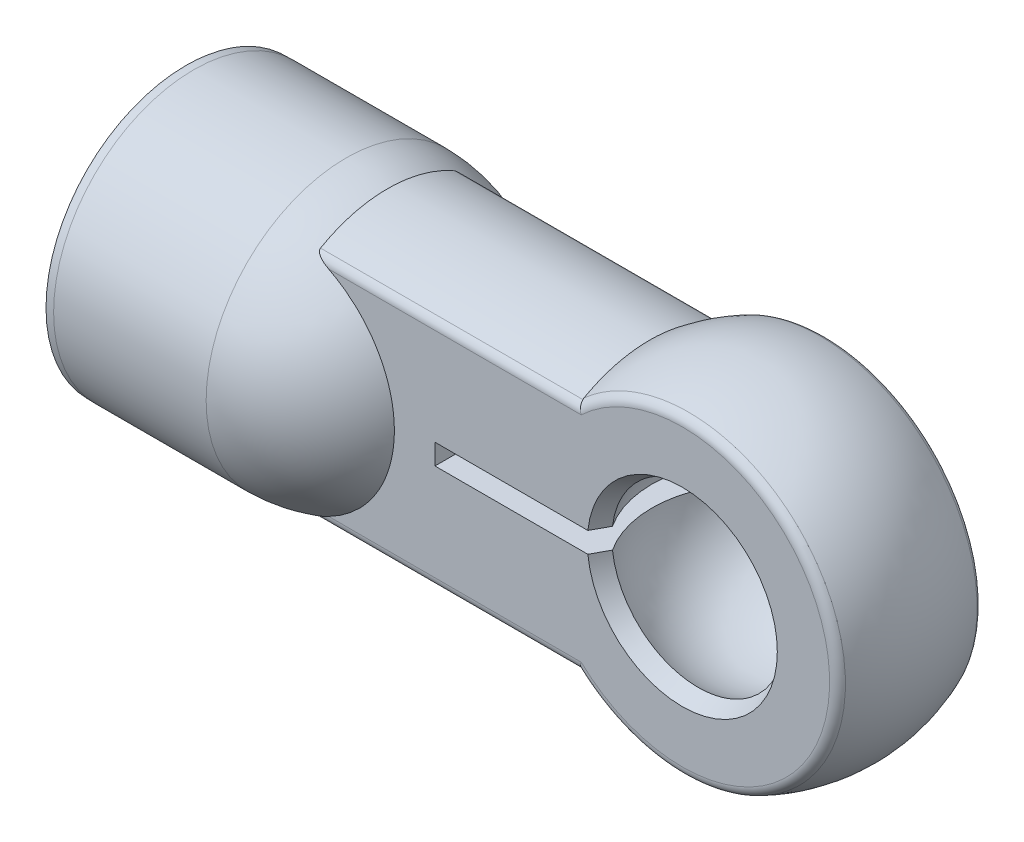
ISO-10303-21;
HEADER;
FILE_DESCRIPTION(('STEP AP214'),'2;1');
FILE_NAME('part.step','',(''),(''),'','','');
FILE_SCHEMA(('AUTOMOTIVE_DESIGN { 1 0 10303 214 1 1 1 1 }'));
ENDSEC;
DATA;
#1=APPLICATION_CONTEXT('core data for automotive mechanical design processes');
#2=APPLICATION_PROTOCOL_DEFINITION('international standard','automotive_design',2000,#1);
#3=PRODUCT_CONTEXT('',#1,'mechanical');
#4=PRODUCT('Part','Part','',(#3));
#5=PRODUCT_RELATED_PRODUCT_CATEGORY('part','',(#4));
#6=PRODUCT_DEFINITION_FORMATION('','',#4);
#7=PRODUCT_DEFINITION_CONTEXT('part definition',#1,'design');
#8=PRODUCT_DEFINITION('design','',#6,#7);
#9=PRODUCT_DEFINITION_SHAPE('','',#8);
#10=(LENGTH_UNIT() NAMED_UNIT(*) SI_UNIT(.MILLI.,.METRE.));
#11=(NAMED_UNIT(*) PLANE_ANGLE_UNIT() SI_UNIT($,.RADIAN.));
#12=(NAMED_UNIT(*) SI_UNIT($,.STERADIAN.) SOLID_ANGLE_UNIT());
#13=UNCERTAINTY_MEASURE_WITH_UNIT(LENGTH_MEASURE(1.E-05),#10,'distance_accuracy_value','');
#14=(GEOMETRIC_REPRESENTATION_CONTEXT(3) GLOBAL_UNCERTAINTY_ASSIGNED_CONTEXT((#13)) GLOBAL_UNIT_ASSIGNED_CONTEXT((#10,
#11,#12)) REPRESENTATION_CONTEXT('',''));
#15=CARTESIAN_POINT('',(0.,0.,0.));
#16=DIRECTION('',(0.,0.,1.));
#17=DIRECTION('',(1.,0.,0.));
#18=AXIS2_PLACEMENT_3D('',#15,#16,#17);
#19=CARTESIAN_POINT('',(-15.,0.,0.));
#20=DIRECTION('',(1.,0.,0.));
#21=DIRECTION('',(0.,0.,-1.));
#22=AXIS2_PLACEMENT_3D('',#19,#20,#21);
#23=PLANE('',#22);
#24=CARTESIAN_POINT('',(-15.,0.,0.));
#25=DIRECTION('',(1.,0.,0.));
#26=DIRECTION('',(0.,0.,-1.));
#27=AXIS2_PLACEMENT_3D('',#24,#25,#26);
#28=CIRCLE('',#27,2.1);
#29=CARTESIAN_POINT('',(-15.,0.,-2.1));
#30=VERTEX_POINT('',#29);
#31=EDGE_CURVE('E715',#30,#30,#28,.F.);
#32=ORIENTED_EDGE('',*,*,#31,.T.);
#33=EDGE_LOOP('',(#32));
#34=FACE_BOUND('',#33,.T.);
#35=ADVANCED_FACE('F16',(#34),#23,.F.);
#36=CARTESIAN_POINT('',(-15.,0.,0.));
#37=DIRECTION('',(1.,0.,0.));
#38=DIRECTION('',(0.,0.,-1.));
#39=AXIS2_PLACEMENT_3D('',#36,#37,#38);
#40=CYLINDRICAL_SURFACE('',#39,2.1);
#41=ORIENTED_EDGE('',*,*,#31,.F.);
#42=EDGE_LOOP('',(#41));
#43=FACE_BOUND('',#42,.T.);
#44=CARTESIAN_POINT('',(-27.58,0.,0.));
#45=DIRECTION('',(1.,0.,0.));
#46=DIRECTION('',(0.,0.,-1.));
#47=AXIS2_PLACEMENT_3D('',#44,#45,#46);
#48=CIRCLE('',#47,2.1);
#49=CARTESIAN_POINT('',(-27.58,0.,-2.1));
#50=VERTEX_POINT('',#49);
#51=EDGE_CURVE('E163',#50,#50,#48,.F.);
#52=ORIENTED_EDGE('',*,*,#51,.T.);
#53=EDGE_LOOP('',(#52));
#54=FACE_BOUND('',#53,.T.);
#55=ADVANCED_FACE('F727',(#43,#54),#40,.F.);
#56=CARTESIAN_POINT('',(-27.58,-6.8,-9.9));
#57=DIRECTION('',(1.,0.,0.));
#58=DIRECTION('',(0.,0.,-1.));
#59=AXIS2_PLACEMENT_3D('',#56,#57,#58);
#60=PLANE('',#59);
#61=ORIENTED_EDGE('',*,*,#51,.F.);
#62=EDGE_LOOP('',(#61));
#63=FACE_BOUND('',#62,.T.);
#64=CARTESIAN_POINT('',(-27.58,-6.78937405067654,0.));
#65=CARTESIAN_POINT('',(-27.58,-6.78939458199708,-0.190953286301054));
#66=CARTESIAN_POINT('',(-27.58,-6.78131898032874,-0.381903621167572));
#67=CARTESIAN_POINT('',(-27.58,-6.74912380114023,-0.762438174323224));
#68=CARTESIAN_POINT('',(-27.58,-6.72500499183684,-0.952022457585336));
#69=CARTESIAN_POINT('',(-27.58,-6.66089420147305,-1.32835092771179));
#70=CARTESIAN_POINT('',(-27.58,-6.62091338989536,-1.51509701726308));
#71=CARTESIAN_POINT('',(-27.58,-6.52536945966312,-1.88455697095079));
#72=CARTESIAN_POINT('',(-27.58,-6.46980653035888,-2.0672708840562));
#73=CARTESIAN_POINT('',(-27.58,-6.34347305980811,-2.42742222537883));
#74=CARTESIAN_POINT('',(-27.58,-6.27269816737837,-2.60485812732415));
#75=CARTESIAN_POINT('',(-27.58,-6.11642478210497,-2.95320201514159));
#76=CARTESIAN_POINT('',(-27.58,-6.03092085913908,-3.12410756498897));
#77=CARTESIAN_POINT('',(-27.58,-5.84586800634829,-3.45801111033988));
#78=CARTESIAN_POINT('',(-27.58,-5.74632704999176,-3.62101352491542));
#79=CARTESIAN_POINT('',(-27.58,-5.53383167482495,-3.93811467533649));
#80=CARTESIAN_POINT('',(-27.58,-5.42087231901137,-4.09221010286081));
#81=CARTESIAN_POINT('',(-27.58,-5.1824141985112,-4.3902845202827));
#82=CARTESIAN_POINT('',(-27.58,-5.05691979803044,-4.53426700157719));
#83=CARTESIAN_POINT('',(-27.58,-4.79420201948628,-4.81120243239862));
#84=CARTESIAN_POINT('',(-27.58,-4.65697432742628,-4.94415128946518));
#85=CARTESIAN_POINT('',(-27.58,-4.37183668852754,-5.19798712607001));
#86=CARTESIAN_POINT('',(-27.58,-4.22392906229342,-5.31887671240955));
#87=CARTESIAN_POINT('',(-27.58,-3.91840004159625,-5.54780984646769));
#88=CARTESIAN_POINT('',(-27.58,-3.76077508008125,-5.65584863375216));
#89=CARTESIAN_POINT('',(-27.58,-3.43704897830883,-5.85821792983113));
#90=CARTESIAN_POINT('',(-27.58,-3.27095136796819,-5.95255408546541));
#91=CARTESIAN_POINT('',(-27.58,-2.93133772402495,-6.12693307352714));
#92=CARTESIAN_POINT('',(-27.58,-2.75781897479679,-6.20697061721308));
#93=CARTESIAN_POINT('',(-27.58,-2.40473104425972,-6.35210885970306));
#94=CARTESIAN_POINT('',(-27.58,-2.22516451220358,-6.41721600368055));
#95=CARTESIAN_POINT('',(-27.58,-1.86111880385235,-6.53209628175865));
#96=CARTESIAN_POINT('',(-27.58,-1.67663784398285,-6.58186376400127));
#97=CARTESIAN_POINT('',(-27.58,-1.30417120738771,-6.66567100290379));
#98=CARTESIAN_POINT('',(-27.58,-1.11618614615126,-6.69971349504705));
#99=CARTESIAN_POINT('',(-27.58,-0.738012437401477,-6.75184208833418));
#100=CARTESIAN_POINT('',(-27.58,-0.547823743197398,-6.76992785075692));
#101=CARTESIAN_POINT('',(-27.58,-0.166596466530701,-6.79001329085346));
#102=CARTESIAN_POINT('',(-27.58,0.0244421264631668,-6.79201276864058));
#103=CARTESIAN_POINT('',(-27.58,0.406008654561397,-6.77991090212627));
#104=CARTESIAN_POINT('',(-27.58,0.596536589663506,-6.76580955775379));
#105=CARTESIAN_POINT('',(-27.58,0.97572736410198,-6.721606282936));
#106=CARTESIAN_POINT('',(-27.58,1.1643902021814,-6.69150434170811));
#107=CARTESIAN_POINT('',(-27.58,1.53850534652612,-6.61551469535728));
#108=CARTESIAN_POINT('',(-27.58,1.72395772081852,-6.56962732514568));
#109=CARTESIAN_POINT('',(-27.58,2.09037275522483,-6.46238261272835));
#110=CARTESIAN_POINT('',(-27.58,2.27133454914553,-6.40102231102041));
#111=CARTESIAN_POINT('',(-27.58,2.62737895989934,-6.26329788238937));
#112=CARTESIAN_POINT('',(-27.58,2.80246371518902,-6.18693928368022));
#113=CARTESIAN_POINT('',(-27.58,3.14564750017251,-6.01971353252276));
#114=CARTESIAN_POINT('',(-27.58,3.31374374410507,-5.9288406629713));
#115=CARTESIAN_POINT('',(-27.58,3.64162090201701,-5.73329047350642));
#116=CARTESIAN_POINT('',(-27.58,3.80140486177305,-5.6286182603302));
#117=CARTESIAN_POINT('',(-27.58,4.11163825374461,-5.40615172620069));
#118=CARTESIAN_POINT('',(-27.58,4.26208468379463,-5.28835321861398));
#119=CARTESIAN_POINT('',(-27.58,4.55246369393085,-5.04054492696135));
#120=CARTESIAN_POINT('',(-27.58,4.69240013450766,-4.91053966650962));
#121=CARTESIAN_POINT('',(-27.58,4.96085768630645,-4.63917307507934));
#122=CARTESIAN_POINT('',(-27.58,5.08937611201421,-4.49780908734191));
#123=CARTESIAN_POINT('',(-27.58,5.33400175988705,-4.20481084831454));
#124=CARTESIAN_POINT('',(-27.58,5.45011354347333,-4.0531804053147));
#125=CARTESIAN_POINT('',(-27.58,5.66923075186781,-3.74057237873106));
#126=CARTESIAN_POINT('',(-27.58,5.77222710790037,-3.57958843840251));
#127=CARTESIAN_POINT('',(-27.58,5.96425161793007,-3.24957455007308));
#128=CARTESIAN_POINT('',(-27.58,6.05328491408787,-3.08054759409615));
#129=CARTESIAN_POINT('',(-27.58,6.21687651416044,-2.73542511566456));
#130=CARTESIAN_POINT('',(-27.58,6.29142052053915,-2.55932281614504));
#131=CARTESIAN_POINT('',(-27.58,6.42536844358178,-2.20152568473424));
#132=CARTESIAN_POINT('',(-27.58,6.48477804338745,-2.01983298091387));
#133=CARTESIAN_POINT('',(-27.58,6.58801362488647,-1.65229420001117));
#134=CARTESIAN_POINT('',(-27.58,6.63185670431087,-1.46645291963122));
#135=CARTESIAN_POINT('',(-27.58,6.70372272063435,-1.09181239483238));
#136=CARTESIAN_POINT('',(-27.58,6.7317534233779,-0.903014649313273));
#137=CARTESIAN_POINT('',(-27.58,6.76431747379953,-0.594838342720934));
#138=CARTESIAN_POINT('',(-27.58,6.77371967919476,-0.475953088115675));
#139=CARTESIAN_POINT('',(-27.58,6.78624346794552,-0.238049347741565));
#140=CARTESIAN_POINT('',(-27.58,6.78937540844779,-0.119031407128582));
#141=CARTESIAN_POINT('',(-27.58,6.78937405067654,0.));
#142=B_SPLINE_CURVE_WITH_KNOTS('',3,(#64,#65,#66,#67,#68,#69,#70,#71,#72,#73,#74,#75,#76,#77,
#78,#79,#80,#81,#82,#83,#84,#85,#86,#87,#88,#89,#90,#91,#92,#93,#94,#95,#96,#97,#98,#99,#100,
#101,#102,#103,#104,#105,#106,#107,#108,#109,#110,#111,#112,#113,#114,#115,#116,#117,#118,#119,
#120,#121,#122,#123,#124,#125,#126,#127,#128,#129,#130,#131,#132,#133,#134,#135,#136,#137,#138,
#139,#140,#141),.UNSPECIFIED.,.F.,.F.,(4,2,2,2,2,2,2,2,2,2,2,2,2,2,2,2,2,2,2,2,2,2,2,2,2,2,2,2,
2,2,2,2,2,2,2,2,2,2,4),(0.,0.572685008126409,1.14534259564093,1.71759765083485,2.28984575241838,
2.86225775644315,3.43488124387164,4.00718076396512,4.57969150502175,5.15200361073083,
5.72452705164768,6.29692646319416,6.86953725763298,7.44191140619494,8.01449682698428,
8.58683460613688,9.15938301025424,9.73183177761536,10.3042926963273,10.8767607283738,
11.4492287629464,12.0216971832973,12.5941534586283,13.1667193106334,13.7390745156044,
14.3116557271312,14.8840256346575,15.4565786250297,16.0289202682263,16.6013961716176,
17.1736608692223,17.7463191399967,18.3187660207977,18.8917749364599,19.4645683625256,
20.0367306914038,20.6086117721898,20.9662292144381,21.3232554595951),.UNSPECIFIED.);
#143=CARTESIAN_POINT('',(-27.58,-6.78937405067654,0.));
#144=VERTEX_POINT('',#143);
#145=CARTESIAN_POINT('',(-27.58,6.78937405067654,0.));
#146=VERTEX_POINT('',#145);
#147=EDGE_CURVE('E162',#144,#146,#142,.T.);
#148=ORIENTED_EDGE('',*,*,#147,.F.);
#149=CARTESIAN_POINT('',(-27.58,0.,0.));
#150=DIRECTION('',(-1.,0.,0.));
#151=DIRECTION('',(0.,0.,1.));
#152=AXIS2_PLACEMENT_3D('',#149,#150,#151);
#153=CIRCLE('',#152,6.78937405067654);
#154=EDGE_CURVE('E158',#146,#144,#153,.F.);
#155=ORIENTED_EDGE('',*,*,#154,.F.);
#156=EDGE_LOOP('',(#148,#155));
#157=FACE_BOUND('',#156,.T.);
#158=ADVANCED_FACE('F165',(#63,#157),#60,.F.);
#159=CARTESIAN_POINT('',(-27.2,0.,0.));
#160=DIRECTION('',(-0.99843736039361,0.0558823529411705,0.));
#161=DIRECTION('',(0.,0.,-1.));
#162=AXIS2_PLACEMENT_3D('',#159,#160,#161);
#163=SPHERICAL_SURFACE('',#162,6.8);
#164=CARTESIAN_POINT('',(-27.2,0.,0.));
#165=DIRECTION('',(-1.,0.,0.));
#166=DIRECTION('',(0.,0.,1.));
#167=AXIS2_PLACEMENT_3D('',#164,#165,#166);
#168=CIRCLE('',#167,6.8);
#169=CARTESIAN_POINT('',(-27.2,0.,6.8));
#170=VERTEX_POINT('',#169);
#171=EDGE_CURVE('E288',#170,#170,#168,.F.);
#172=ORIENTED_EDGE('',*,*,#171,.F.);
#173=EDGE_LOOP('',(#172));
#174=FACE_BOUND('',#173,.T.);
#175=ORIENTED_EDGE('',*,*,#147,.T.);
#176=ORIENTED_EDGE('',*,*,#154,.T.);
#177=EDGE_LOOP('',(#175,#176));
#178=FACE_BOUND('',#177,.T.);
#179=ADVANCED_FACE('F161',(#174,#178),#163,.T.);
#180=CARTESIAN_POINT('',(-68.3447,5.196152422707,3.));
#181=DIRECTION('',(1.,0.,0.));
#182=DIRECTION('',(0.,0.,-1.));
#183=AXIS2_PLACEMENT_3D('',#180,#181,#182);
#184=CYLINDRICAL_SURFACE('',#183,0.5);
#185=DIRECTION('',(-1.,0.,0.));
#186=VECTOR('',#185,1.);
#187=CARTESIAN_POINT('',(9.9125,5.62916512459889,3.24999999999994));
#188=LINE('',#187,#186);
#189=CARTESIAN_POINT('',(-17.8025015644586,5.62916512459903,3.25000000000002));
#190=VERTEX_POINT('',#189);
#191=CARTESIAN_POINT('',(-5.07453908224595,5.62916512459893,3.24999999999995));
#192=VERTEX_POINT('',#191);
#193=EDGE_CURVE('E451',#190,#192,#188,.F.);
#194=ORIENTED_EDGE('',*,*,#193,.F.);
#195=CARTESIAN_POINT('',(-17.1561391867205,5.1961524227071,3.5));
#196=CARTESIAN_POINT('',(-17.1809328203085,5.20877080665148,3.4999955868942));
#197=CARTESIAN_POINT('',(-17.2056916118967,5.22146374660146,3.49952206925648));
#198=CARTESIAN_POINT('',(-17.2552107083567,5.24708021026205,3.49756750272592));
#199=CARTESIAN_POINT('',(-17.2799703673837,5.26000458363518,3.4960812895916));
#200=CARTESIAN_POINT('',(-17.329357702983,5.28606308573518,3.49202649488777));
#201=CARTESIAN_POINT('',(-17.3539849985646,5.29919759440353,3.489455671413));
#202=CARTESIAN_POINT('',(-17.4032077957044,5.32581042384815,3.48309214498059));
#203=CARTESIAN_POINT('',(-17.4278007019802,5.33929083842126,3.47928790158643));
#204=CARTESIAN_POINT('',(-17.4765456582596,5.36650231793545,3.47030415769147));
#205=CARTESIAN_POINT('',(-17.5006983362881,5.38023295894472,3.46512681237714));
#206=CARTESIAN_POINT('',(-17.5483665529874,5.40802563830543,3.45314364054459));
#207=CARTESIAN_POINT('',(-17.5718829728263,5.42208716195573,3.44634020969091));
#208=CARTESIAN_POINT('',(-17.6114926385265,5.44667329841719,3.43287029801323));
#209=CARTESIAN_POINT('',(-17.62782159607,5.45708651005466,3.42669827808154));
#210=CARTESIAN_POINT('',(-17.6597580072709,5.47823329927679,3.41302474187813));
#211=CARTESIAN_POINT('',(-17.6753642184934,5.48896737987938,3.40552103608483));
#212=CARTESIAN_POINT('',(-17.7055509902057,5.5109095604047,3.38874352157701));
#213=CARTESIAN_POINT('',(-17.7201193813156,5.52212139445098,3.3794523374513));
#214=CARTESIAN_POINT('',(-17.747202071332,5.54493306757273,3.35859438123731));
#215=CARTESIAN_POINT('',(-17.759724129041,5.55653123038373,3.34703658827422));
#216=CARTESIAN_POINT('',(-17.7759586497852,5.5743047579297,3.32723573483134));
#217=CARTESIAN_POINT('',(-17.7810184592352,5.58041766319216,3.3200552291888));
#218=CARTESIAN_POINT('',(-17.7897549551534,5.59257273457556,3.30486882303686));
#219=CARTESIAN_POINT('',(-17.7934369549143,5.59861508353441,3.29686624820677));
#220=CARTESIAN_POINT('',(-17.7982658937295,5.60881255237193,3.28242918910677));
#221=CARTESIAN_POINT('',(-17.7998329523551,5.61302554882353,3.27617684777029));
#222=CARTESIAN_POINT('',(-17.8019607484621,5.6212668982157,3.26332004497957));
#223=CARTESIAN_POINT('',(-17.802513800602,5.62529361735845,3.25671328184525));
#224=CARTESIAN_POINT('',(-17.8025015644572,5.62916512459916,3.25000000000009));
#225=B_SPLINE_CURVE_WITH_KNOTS('',3,(#195,#196,#197,#198,#199,#200,#201,#202,#203,#204,#205,
#206,#207,#208,#209,#210,#211,#212,#213,#214,#215,#216,#217,#218,#219,#220,#221,#222,#223,#224),
.UNSPECIFIED.,.F.,.F.,(4,2,2,2,2,2,2,2,2,2,2,2,2,2,4),(0.,0.083459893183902,0.167348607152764,
0.251411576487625,0.336284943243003,0.42102587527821,0.505642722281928,0.566580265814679,
0.627618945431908,0.689284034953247,0.750709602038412,0.782724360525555,0.814614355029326,
0.837643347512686,0.860846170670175),.UNSPECIFIED.);
#226=CARTESIAN_POINT('',(-17.1561391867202,5.19615242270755,3.5));
#227=VERTEX_POINT('',#226);
#228=EDGE_CURVE('E274',#227,#190,#225,.T.);
#229=ORIENTED_EDGE('',*,*,#228,.F.);
#230=DIRECTION('',(-1.,0.,0.));
#231=VECTOR('',#230,1.);
#232=CARTESIAN_POINT('',(8.25,5.196152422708,3.5));
#233=LINE('',#232,#231);
#234=CARTESIAN_POINT('',(-4.905354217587,5.196152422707,3.5));
#235=VERTEX_POINT('',#234);
#236=EDGE_CURVE('E514',#227,#235,#233,.F.);
#237=ORIENTED_EDGE('',*,*,#236,.T.);
#238=CARTESIAN_POINT('',(-5.07453908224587,5.62916512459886,3.24999999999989));
#239=CARTESIAN_POINT('',(-5.07355903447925,5.62661398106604,3.25441864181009));
#240=CARTESIAN_POINT('',(-5.07255463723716,5.62399687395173,3.25879374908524));
#241=CARTESIAN_POINT('',(-5.07048626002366,5.61860456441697,3.26750186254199));
#242=CARTESIAN_POINT('',(-5.06942173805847,5.61582791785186,3.27183384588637));
#243=CARTESIAN_POINT('',(-5.06723206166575,5.61011599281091,3.28044928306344));
#244=CARTESIAN_POINT('',(-5.06610636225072,5.60717928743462,3.28473165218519));
#245=CARTESIAN_POINT('',(-5.06379345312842,5.60114690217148,3.29324131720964));
#246=CARTESIAN_POINT('',(-5.06260569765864,5.59804981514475,3.29746746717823));
#247=CARTESIAN_POINT('',(-5.06016793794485,5.591696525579,3.30585798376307));
#248=CARTESIAN_POINT('',(-5.05891738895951,5.58843893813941,3.31002114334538));
#249=CARTESIAN_POINT('',(-5.05635346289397,5.58176471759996,3.31827882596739));
#250=CARTESIAN_POINT('',(-5.05503954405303,5.57834672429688,3.32237208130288));
#251=CARTESIAN_POINT('',(-5.05234846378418,5.57135198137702,3.33048296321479));
#252=CARTESIAN_POINT('',(-5.05097076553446,5.56777389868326,3.33449926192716));
#253=CARTESIAN_POINT('',(-5.04815188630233,5.56045949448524,3.34244910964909));
#254=CARTESIAN_POINT('',(-5.04671017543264,5.55672186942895,3.34638127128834));
#255=CARTESIAN_POINT('',(-5.0437632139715,5.54908913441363,3.35415560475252));
#256=CARTESIAN_POINT('',(-5.04225744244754,5.54519275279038,3.35799633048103));
#257=CARTESIAN_POINT('',(-5.03918249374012,5.53724350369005,3.36558044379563));
#258=CARTESIAN_POINT('',(-5.03761280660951,5.53318939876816,3.36932232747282));
#259=CARTESIAN_POINT('',(-5.03441036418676,5.52492595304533,3.37670131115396));
#260=CARTESIAN_POINT('',(-5.0327771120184,5.52071541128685,3.38033685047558));
#261=CARTESIAN_POINT('',(-5.02944807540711,5.5121406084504,3.38749561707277));
#262=CARTESIAN_POINT('',(-5.0277518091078,5.5077751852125,3.39101722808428));
#263=CARTESIAN_POINT('',(-5.02429753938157,5.49889237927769,3.39794053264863));
#264=CARTESIAN_POINT('',(-5.02253907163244,5.49437387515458,3.40134055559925));
#265=CARTESIAN_POINT('',(-5.01896126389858,5.48518703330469,3.40801304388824));
#266=CARTESIAN_POINT('',(-5.0171414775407,5.48051761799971,3.41128378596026));
#267=CARTESIAN_POINT('',(-5.01344272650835,5.4710310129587,3.41768994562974));
#268=CARTESIAN_POINT('',(-5.01156334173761,5.46621278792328,3.42082358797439));
#269=CARTESIAN_POINT('',(-5.00774507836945,5.45643222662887,3.42694807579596));
#270=CARTESIAN_POINT('',(-5.00580578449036,5.45146891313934,3.42993709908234));
#271=CARTESIAN_POINT('',(-5.00087349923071,5.4388272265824,3.43725035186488));
#272=CARTESIAN_POINT('',(-4.99786013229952,5.43108713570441,3.44145484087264));
#273=CARTESIAN_POINT('',(-4.99154436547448,5.41484669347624,3.44972687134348));
#274=CARTESIAN_POINT('',(-4.9882368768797,5.40633197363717,3.45376224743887));
#275=CARTESIAN_POINT('',(-4.9813130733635,5.38853243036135,3.46159398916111));
#276=CARTESIAN_POINT('',(-4.977691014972,5.37923450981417,3.46535565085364));
#277=CARTESIAN_POINT('',(-4.97210639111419,5.3649321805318,3.47065145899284));
#278=CARTESIAN_POINT('',(-4.97017488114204,5.35999151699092,3.47239337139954));
#279=CARTESIAN_POINT('',(-4.96623061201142,5.34991586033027,3.47576982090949));
#280=CARTESIAN_POINT('',(-4.96421716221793,5.34477950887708,3.47739951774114));
#281=CARTESIAN_POINT('',(-4.96010882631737,5.33431378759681,3.48053591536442));
#282=CARTESIAN_POINT('',(-4.95801328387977,5.32898317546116,3.48203760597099));
#283=CARTESIAN_POINT('',(-4.95374101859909,5.31813063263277,3.48490199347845));
#284=CARTESIAN_POINT('',(-4.95156368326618,5.31260757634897,3.48625951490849));
#285=CARTESIAN_POINT('',(-4.94712872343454,5.30137261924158,3.48881907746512));
#286=CARTESIAN_POINT('',(-4.94487054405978,5.29565972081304,3.4900157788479));
#287=CARTESIAN_POINT('',(-4.9402754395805,5.28404828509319,3.49223681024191));
#288=CARTESIAN_POINT('',(-4.93793802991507,5.27814888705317,3.49325563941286));
#289=CARTESIAN_POINT('',(-4.93318672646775,5.26616846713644,3.49510366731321));
#290=CARTESIAN_POINT('',(-4.93077243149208,5.26008673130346,3.49592720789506));
#291=CARTESIAN_POINT('',(-4.92587039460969,5.24774650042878,3.4973670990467));
#292=CARTESIAN_POINT('',(-4.92338234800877,5.24148744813,3.49797763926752));
#293=CARTESIAN_POINT('',(-4.91833666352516,5.22879835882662,3.49897370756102));
#294=CARTESIAN_POINT('',(-4.91577883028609,5.22236793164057,3.49935327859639));
#295=CARTESIAN_POINT('',(-4.91059835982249,5.20934278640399,3.49986950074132));
#296=CARTESIAN_POINT('',(-4.90797565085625,5.20274785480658,3.50000005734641));
#297=CARTESIAN_POINT('',(-4.905354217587,5.196152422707,3.5));
#298=B_SPLINE_CURVE_WITH_KNOTS('',3,(#238,#239,#240,#241,#242,#243,#244,#245,#246,#247,#248,
#249,#250,#251,#252,#253,#254,#255,#256,#257,#258,#259,#260,#261,#262,#263,#264,#265,#266,#267,
#268,#269,#270,#271,#272,#273,#274,#275,#276,#277,#278,#279,#280,#281,#282,#283,#284,#285,#286,
#287,#288,#289,#290,#291,#292,#293,#294,#295,#296,#297),.UNSPECIFIED.,.F.,.F.,(4,2,2,2,2,2,2,2,
2,2,2,2,2,2,2,2,2,2,2,2,2,2,2,2,2,2,2,2,2,4),(0.,0.0155857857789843,0.0313464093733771,
0.0472833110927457,0.0633978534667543,0.0796913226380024,0.0961649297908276,0.112819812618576,
0.129657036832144,0.146677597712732,0.163882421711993,0.181272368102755,0.198848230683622,
0.216610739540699,0.234560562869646,0.252698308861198,0.271024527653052,0.298940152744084,
0.328884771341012,0.360857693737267,0.377606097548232,0.394860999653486,0.412622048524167,
0.430888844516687,0.449660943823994,0.46893786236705,0.488719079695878,0.509004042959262,
0.529792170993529,0.55108285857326),.UNSPECIFIED.);
#299=EDGE_CURVE('E166',#192,#235,#298,.T.);
#300=ORIENTED_EDGE('',*,*,#299,.F.);
#301=EDGE_LOOP('',(#194,#229,#237,#300));
#302=FACE_BOUND('',#301,.T.);
#303=ADVANCED_FACE('F183',(#302),#184,.T.);
#304=CARTESIAN_POINT('',(0.,0.,3.));
#305=DIRECTION('',(0.,0.,-1.));
#306=DIRECTION('',(0.998982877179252,-0.0450911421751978,0.));
#307=AXIS2_PLACEMENT_3D('',#304,#305,#306);
#308=TOROIDAL_SURFACE('',#307,7.145802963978,0.5);
#309=CARTESIAN_POINT('',(-5.080600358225,-5.66138222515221,3.19354838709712));
#310=CARTESIAN_POINT('',(-5.08060034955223,-5.66001765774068,3.19596743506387));
#311=CARTESIAN_POINT('',(-5.08056895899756,-5.65865152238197,3.19838563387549));
#312=CARTESIAN_POINT('',(-5.08044262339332,-5.6559258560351,3.20320313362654));
#313=CARTESIAN_POINT('',(-5.08034809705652,-5.6545663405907,3.20560245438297));
#314=CARTESIAN_POINT('',(-5.08009549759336,-5.65185397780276,3.21038223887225));
#315=CARTESIAN_POINT('',(-5.07993781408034,-5.65050114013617,3.21276272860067));
#316=CARTESIAN_POINT('',(-5.07955893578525,-5.64780220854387,3.21750487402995));
#317=CARTESIAN_POINT('',(-5.07933809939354,-5.64645611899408,3.2198665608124));
#318=CARTESIAN_POINT('',(-5.07883294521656,-5.64377075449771,3.22457112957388));
#319=CARTESIAN_POINT('',(-5.07854895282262,-5.64243147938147,3.22691404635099));
#320=CARTESIAN_POINT('',(-5.07791752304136,-5.63975981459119,3.23158110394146));
#321=CARTESIAN_POINT('',(-5.07757037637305,-5.63842742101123,3.23390528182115));
#322=CARTESIAN_POINT('',(-5.07681266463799,-5.63576958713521,3.23853489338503));
#323=CARTESIAN_POINT('',(-5.07640235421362,-5.63444414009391,3.24084036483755));
#324=CARTESIAN_POINT('',(-5.07551838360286,-5.63180027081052,3.24543259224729));
#325=CARTESIAN_POINT('',(-5.07504494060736,-5.63048183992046,3.24771938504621));
#326=CARTESIAN_POINT('',(-5.074539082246,-5.62916512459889,3.24999999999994));
#327=B_SPLINE_CURVE_WITH_KNOTS('',3,(#309,#310,#311,#312,#313,#314,#315,#316,#317,#318,#319,
#320,#321,#322,#323,#324,#325,#326),.UNSPECIFIED.,.F.,.F.,(4,2,2,2,2,2,2,2,4),(0.,
0.00833200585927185,0.0166092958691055,0.0248362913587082,0.0330174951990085,0.0411574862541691,
0.0492609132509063,0.0573324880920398,0.0653769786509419),.UNSPECIFIED.);
#328=CARTESIAN_POINT('',(-5.08060035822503,-5.66138222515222,3.1935483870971));
#329=VERTEX_POINT('',#328);
#330=CARTESIAN_POINT('',(-5.07453908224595,-5.62916512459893,3.24999999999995));
#331=VERTEX_POINT('',#330);
#332=EDGE_CURVE('E646',#329,#331,#327,.T.);
#333=ORIENTED_EDGE('',*,*,#332,.F.);
#334=CARTESIAN_POINT('',(0.,0.,3.19354838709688));
#335=DIRECTION('',(0.,0.,-1.));
#336=DIRECTION('',(0.998982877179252,-0.0450911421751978,0.));
#337=AXIS2_PLACEMENT_3D('',#334,#335,#336);
#338=CIRCLE('',#337,7.60682251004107);
#339=CARTESIAN_POINT('',(-5.080600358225,5.66138222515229,3.193548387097));
#340=VERTEX_POINT('',#339);
#341=EDGE_CURVE('E168',#329,#340,#338,.F.);
#342=ORIENTED_EDGE('',*,*,#341,.T.);
#343=CARTESIAN_POINT('',(-5.074539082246,5.62916512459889,3.24999999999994));
#344=CARTESIAN_POINT('',(-5.0750449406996,5.63048184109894,3.24771938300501));
#345=CARTESIAN_POINT('',(-5.0755183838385,5.63180027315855,3.24543258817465));
#346=CARTESIAN_POINT('',(-5.07640235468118,5.63444414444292,3.24084035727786));
#347=CARTESIAN_POINT('',(-5.07681266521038,5.63576959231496,3.2385348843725));
#348=CARTESIAN_POINT('',(-5.07757037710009,5.63842742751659,3.23390527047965));
#349=CARTESIAN_POINT('',(-5.07791752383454,5.63975982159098,3.23158109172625));
#350=CARTESIAN_POINT('',(-5.07854895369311,5.64243148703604,3.22691403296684));
#351=CARTESIAN_POINT('',(-5.07883294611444,5.64377076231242,3.22457111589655));
#352=CARTESIAN_POINT('',(-5.07933810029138,5.64645612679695,3.21986654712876));
#353=CARTESIAN_POINT('',(-5.07955893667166,5.64780221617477,3.21750486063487));
#354=CARTESIAN_POINT('',(-5.07993781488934,5.65050114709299,3.21276271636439));
#355=CARTESIAN_POINT('',(-5.08009549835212,5.65185398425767,3.21038222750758));
#356=CARTESIAN_POINT('',(-5.08034809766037,5.65456634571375,3.20560244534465));
#357=CARTESIAN_POINT('',(-5.08044262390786,5.65592586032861,3.203203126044));
#358=CARTESIAN_POINT('',(-5.08056895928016,5.65865152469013,3.19838562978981));
#359=CARTESIAN_POINT('',(-5.08060034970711,5.6600176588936,3.19596743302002));
#360=CARTESIAN_POINT('',(-5.080600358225,5.66138222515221,3.19354838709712));
#361=B_SPLINE_CURVE_WITH_KNOTS('',3,(#343,#344,#345,#346,#347,#348,#349,#350,#351,#352,#353,
#354,#355,#356,#357,#358,#359,#360),.UNSPECIFIED.,.F.,.F.,(4,2,2,2,2,2,2,2,4),(0.,
0.00804449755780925,0.0161160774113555,0.0242195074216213,0.0323594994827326,0.0405407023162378,
0.0487676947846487,0.0570449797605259,0.0653769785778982),.UNSPECIFIED.);
#362=EDGE_CURVE('E636',#192,#340,#361,.T.);
#363=ORIENTED_EDGE('',*,*,#362,.F.);
#364=ORIENTED_EDGE('',*,*,#299,.T.);
#365=CARTESIAN_POINT('',(0.,0.,3.5));
#366=DIRECTION('',(0.,0.,-1.));
#367=DIRECTION('',(-0.686466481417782,0.727161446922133,0.));
#368=AXIS2_PLACEMENT_3D('',#365,#366,#367);
#369=CIRCLE('',#368,7.14580296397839);
#370=CARTESIAN_POINT('',(7.13853480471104,-0.322212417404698,3.5));
#371=VERTEX_POINT('',#370);
#372=EDGE_CURVE('E482',#235,#371,#369,.T.);
#373=ORIENTED_EDGE('',*,*,#372,.T.);
#374=CARTESIAN_POINT('',(0.,0.,3.5));
#375=DIRECTION('',(0.,0.,-1.));
#376=DIRECTION('',(0.998982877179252,-0.0450911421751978,0.));
#377=AXIS2_PLACEMENT_3D('',#374,#375,#376);
#378=CIRCLE('',#377,7.14580296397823);
#379=CARTESIAN_POINT('',(-4.90535421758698,-5.19615242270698,3.5));
#380=VERTEX_POINT('',#379);
#381=EDGE_CURVE('E511',#371,#380,#378,.T.);
#382=ORIENTED_EDGE('',*,*,#381,.T.);
#383=CARTESIAN_POINT('',(-4.905354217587,-5.196152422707,3.5));
#384=CARTESIAN_POINT('',(-4.9079749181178,-5.20274601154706,3.50000005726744));
#385=CARTESIAN_POINT('',(-4.91059688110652,-5.20933910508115,3.49986957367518));
#386=CARTESIAN_POINT('',(-4.91577574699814,-5.22236035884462,3.4993536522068));
#387=CARTESIAN_POINT('',(-4.91833272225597,-5.22878873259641,3.49897431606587));
#388=CARTESIAN_POINT('',(-4.92337658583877,-5.24147350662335,3.49797889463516));
#389=CARTESIAN_POINT('',(-4.92586367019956,-5.24773029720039,3.49736877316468));
#390=CARTESIAN_POINT('',(-4.93076368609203,-5.26006580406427,3.49592991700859));
#391=CARTESIAN_POINT('',(-4.93317692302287,-5.26614507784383,3.49510699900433));
#392=CARTESIAN_POINT('',(-4.93792602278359,-5.27812038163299,3.49326043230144));
#393=CARTESIAN_POINT('',(-4.94026228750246,-5.28401712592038,3.49224244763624));
#394=CARTESIAN_POINT('',(-4.94485502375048,-5.29562307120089,3.49002333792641));
#395=CARTESIAN_POINT('',(-4.94711198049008,-5.3013331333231,3.48882771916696));
#396=CARTESIAN_POINT('',(-4.95154442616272,-5.3125622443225,3.48627056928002));
#397=CARTESIAN_POINT('',(-4.9537204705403,-5.31808229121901,3.48491438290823));
#398=CARTESIAN_POINT('',(-4.95799009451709,-5.32892865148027,3.48205292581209));
#399=CARTESIAN_POINT('',(-4.9600842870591,-5.33425609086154,3.48055283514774));
#400=CARTESIAN_POINT('',(-4.96418987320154,-5.34471531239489,3.47741990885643));
#401=CARTESIAN_POINT('',(-4.96620192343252,-5.34984833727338,3.47579208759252));
#402=CARTESIAN_POINT('',(-4.97014335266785,-5.35991719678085,3.47241966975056));
#403=CARTESIAN_POINT('',(-4.9720734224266,-5.36485439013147,3.4706799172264));
#404=CARTESIAN_POINT('',(-4.97765354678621,-5.37914575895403,3.46539110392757));
#405=CARTESIAN_POINT('',(-4.98127262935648,-5.38843633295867,3.46163464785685));
#406=CARTESIAN_POINT('',(-4.98819041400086,-5.40622071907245,3.45381450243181));
#407=CARTESIAN_POINT('',(-4.9914948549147,-5.4147276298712,3.44978553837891));
#408=CARTESIAN_POINT('',(-4.99780455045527,-5.43095203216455,3.4415275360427));
#409=CARTESIAN_POINT('',(-5.00081488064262,-5.4386838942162,3.43733067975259));
#410=CARTESIAN_POINT('',(-5.00574633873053,-5.45132249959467,3.43002504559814));
#411=CARTESIAN_POINT('',(-5.007687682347,-5.45629059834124,3.42703537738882));
#412=CARTESIAN_POINT('',(-5.01150992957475,-5.46608053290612,3.42090934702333));
#413=CARTESIAN_POINT('',(-5.01339124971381,-5.4709033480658,3.41777481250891));
#414=CARTESIAN_POINT('',(-5.01709377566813,-5.48039891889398,3.41136663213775));
#415=CARTESIAN_POINT('',(-5.01891540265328,-5.48507271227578,3.40809476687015));
#416=CARTESIAN_POINT('',(-5.02249678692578,-5.49426809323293,3.40141981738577));
#417=CARTESIAN_POINT('',(-5.02425699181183,-5.4987907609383,3.39801846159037));
#418=CARTESIAN_POINT('',(-5.02771463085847,-5.50768167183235,3.39109229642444));
#419=CARTESIAN_POINT('',(-5.02941253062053,-5.51205103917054,3.38756916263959));
#420=CARTESIAN_POINT('',(-5.03274472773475,-5.52063350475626,3.38040717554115));
#421=CARTESIAN_POINT('',(-5.03437950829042,-5.52484776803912,3.37676994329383));
#422=CARTESIAN_POINT('',(-5.03758490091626,-5.5331184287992,3.36938741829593));
#423=CARTESIAN_POINT('',(-5.039156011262,-5.53717603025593,3.36564369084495));
#424=CARTESIAN_POINT('',(-5.04223370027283,-5.54513204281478,3.35805575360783));
#425=CARTESIAN_POINT('',(-5.04374079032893,-5.54903169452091,3.35421305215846));
#426=CARTESIAN_POINT('',(-5.04669028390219,-5.55667073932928,3.34643464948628));
#427=CARTESIAN_POINT('',(-5.04813320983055,-5.56041140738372,3.34250039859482));
#428=CARTESIAN_POINT('',(-5.05095441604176,-5.56773166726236,3.33454627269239));
#429=CARTESIAN_POINT('',(-5.05233322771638,-5.57131256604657,3.33052778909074));
#430=CARTESIAN_POINT('',(-5.05502643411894,-5.57831271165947,3.32241245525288));
#431=CARTESIAN_POINT('',(-5.05634136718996,-5.58173329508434,3.31831693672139));
#432=CARTESIAN_POINT('',(-5.05890722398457,-5.58841246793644,3.31005466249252));
#433=CARTESIAN_POINT('',(-5.06015869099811,-5.59167242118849,3.30588917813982));
#434=CARTESIAN_POINT('',(-5.06259819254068,-5.59803021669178,3.29749396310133));
#435=CARTESIAN_POINT('',(-5.06378677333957,-5.60112944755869,3.29326544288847));
#436=CARTESIAN_POINT('',(-5.06610124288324,-5.60716589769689,3.28475100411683));
#437=CARTESIAN_POINT('',(-5.06722767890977,-5.61010452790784,3.28046623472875));
#438=CARTESIAN_POINT('',(-5.06941874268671,-5.61582008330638,3.27184597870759));
#439=CARTESIAN_POINT('',(-5.0704839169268,-5.6185984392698,3.26751157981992));
#440=CARTESIAN_POINT('',(-5.07255351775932,-5.62399395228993,3.2587986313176));
#441=CARTESIAN_POINT('',(-5.07355848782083,-5.62661255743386,3.25442110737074));
#442=CARTESIAN_POINT('',(-5.07453908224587,-5.62916512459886,3.24999999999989));
#443=B_SPLINE_CURVE_WITH_KNOTS('',3,(#383,#384,#385,#386,#387,#388,#389,#390,#391,#392,#393,
#394,#395,#396,#397,#398,#399,#400,#401,#402,#403,#404,#405,#406,#407,#408,#409,#410,#411,#412,
#413,#414,#415,#416,#417,#418,#419,#420,#421,#422,#423,#424,#425,#426,#427,#428,#429,#430,#431,
#432,#433,#434,#435,#436,#437,#438,#439,#440,#441,#442),.UNSPECIFIED.,.F.,.F.,(4,2,2,2,2,2,2,2,
2,2,2,2,2,2,2,2,2,2,2,2,2,2,2,2,2,2,2,2,2,4),(0.,0.021284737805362,0.0420661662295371,
0.0623436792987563,0.0821166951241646,0.101384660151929,0.120147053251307,0.138403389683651,
0.156153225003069,0.173396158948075,0.190131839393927,0.222077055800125,0.251990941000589,
0.279872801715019,0.29821357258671,0.316365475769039,0.334329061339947,0.352104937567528,
0.369693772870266,0.387096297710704,0.404313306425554,0.421345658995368,0.438194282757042,
0.454860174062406,0.471344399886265,0.48764809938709,0.503772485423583,0.519718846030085,
0.535488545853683,0.551083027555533),.UNSPECIFIED.);
#444=EDGE_CURVE('E240',#331,#380,#443,.F.);
#445=ORIENTED_EDGE('',*,*,#444,.F.);
#446=EDGE_LOOP('',(#333,#342,#363,#364,#373,#382,#445));
#447=FACE_BOUND('',#446,.T.);
#448=ADVANCED_FACE('F206',(#447),#308,.T.);
#449=CARTESIAN_POINT('',(51.5947,-5.196152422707,3.));
#450=DIRECTION('',(-1.,0.,0.));
#451=DIRECTION('',(0.,0.,1.));
#452=AXIS2_PLACEMENT_3D('',#449,#450,#451);
#453=CYLINDRICAL_SURFACE('',#452,0.5);
#454=DIRECTION('',(-1.,0.,0.));
#455=VECTOR('',#454,1.);
#456=CARTESIAN_POINT('',(8.25,-5.196152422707,3.5));
#457=LINE('',#456,#455);
#458=CARTESIAN_POINT('',(-17.1561391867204,-5.19615242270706,3.5));
#459=VERTEX_POINT('',#458);
#460=EDGE_CURVE('E503',#380,#459,#457,.T.);
#461=ORIENTED_EDGE('',*,*,#460,.T.);
#462=CARTESIAN_POINT('',(-17.8025015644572,-5.62916512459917,3.25000000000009));
#463=CARTESIAN_POINT('',(-17.8025362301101,-5.623916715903,3.25911214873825));
#464=CARTESIAN_POINT('',(-17.8015066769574,-5.61838991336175,3.26800088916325));
#465=CARTESIAN_POINT('',(-17.7976575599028,-5.60708314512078,3.28501886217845));
#466=CARTESIAN_POINT('',(-17.7948656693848,-5.60130835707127,3.29315764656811));
#467=CARTESIAN_POINT('',(-17.7868534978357,-5.58804852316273,3.31075935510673));
#468=CARTESIAN_POINT('',(-17.7811793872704,-5.58052531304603,3.31998077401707));
#469=CARTESIAN_POINT('',(-17.7681448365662,-5.56548551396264,3.33723098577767));
#470=CARTESIAN_POINT('',(-17.7607734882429,-5.55796929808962,3.34525148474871));
#471=CARTESIAN_POINT('',(-17.7384809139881,-5.53704762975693,3.36627578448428));
#472=CARTESIAN_POINT('',(-17.7222792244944,-5.52380127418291,3.3780563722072));
#473=CARTESIAN_POINT('',(-17.6879770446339,-5.49783456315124,3.39908099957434));
#474=CARTESIAN_POINT('',(-17.669872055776,-5.48511555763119,3.40831883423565));
#475=CARTESIAN_POINT('',(-17.6234547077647,-5.45399449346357,3.42897390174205));
#476=CARTESIAN_POINT('',(-17.5944728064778,-5.43584811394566,3.43925469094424));
#477=CARTESIAN_POINT('',(-17.5352427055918,-5.40017834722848,3.4569099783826));
#478=CARTESIAN_POINT('',(-17.5049919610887,-5.38265635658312,3.46427829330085));
#479=CARTESIAN_POINT('',(-17.44369672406,-5.34803408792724,3.47672924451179));
#480=CARTESIAN_POINT('',(-17.4126505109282,-5.33093491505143,3.48180638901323));
#481=CARTESIAN_POINT('',(-17.3501125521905,-5.2970864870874,3.4900154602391));
#482=CARTESIAN_POINT('',(-17.3186207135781,-5.28033730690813,3.4931469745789));
#483=CARTESIAN_POINT('',(-17.2652208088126,-5.25230399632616,3.4969707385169));
#484=CARTESIAN_POINT('',(-17.243383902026,-5.24094310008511,3.49811899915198));
#485=CARTESIAN_POINT('',(-17.1997536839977,-5.21842007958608,3.49963006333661));
#486=CARTESIAN_POINT('',(-17.1779609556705,-5.20725715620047,3.49999773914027));
#487=CARTESIAN_POINT('',(-17.1561391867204,-5.19615242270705,3.5));
#488=B_SPLINE_CURVE_WITH_KNOTS('',3,(#462,#463,#464,#465,#466,#467,#468,#469,#470,#471,#472,
#473,#474,#475,#476,#477,#478,#479,#480,#481,#482,#483,#484,#485,#486,#487),.UNSPECIFIED.,.F.,
.F.,(4,2,2,2,2,2,2,2,2,2,2,2,4),(0.,0.031403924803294,0.0623265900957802,0.101655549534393,
0.141244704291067,0.212888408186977,0.284705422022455,0.391569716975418,0.498659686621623,
0.606004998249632,0.713373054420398,0.787287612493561,0.860739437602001),.UNSPECIFIED.);
#489=CARTESIAN_POINT('',(-17.8025015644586,-5.62916512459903,3.25000000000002));
#490=VERTEX_POINT('',#489);
#491=EDGE_CURVE('E281',#490,#459,#488,.T.);
#492=ORIENTED_EDGE('',*,*,#491,.F.);
#493=DIRECTION('',(-1.,0.,0.));
#494=VECTOR('',#493,1.);
#495=CARTESIAN_POINT('',(9.9125,-5.62916512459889,3.24999999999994));
#496=LINE('',#495,#494);
#497=EDGE_CURVE('E648',#331,#490,#496,.T.);
#498=ORIENTED_EDGE('',*,*,#497,.F.);
#499=ORIENTED_EDGE('',*,*,#444,.T.);
#500=EDGE_LOOP('',(#461,#492,#498,#499));
#501=FACE_BOUND('',#500,.T.);
#502=ADVANCED_FACE('F210',(#501),#453,.T.);
#503=CARTESIAN_POINT('',(0.,0.,3.50000187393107));
#504=DIRECTION('',(0.,0.,1.));
#505=DIRECTION('',(1.,0.,0.));
#506=AXIS2_PLACEMENT_3D('',#503,#504,#505);
#507=CONICAL_SURFACE('',#506,4.60970813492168,0.496926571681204);
#508=CARTESIAN_POINT('',(-4.16073435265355,0.500000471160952,2.72732089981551));
#509=CARTESIAN_POINT('',(-4.23106419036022,0.500000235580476,2.85608268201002));
#510=CARTESIAN_POINT('',(-4.3013771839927,0.500000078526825,2.98485365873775));
#511=CARTESIAN_POINT('',(-4.4419694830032,0.499999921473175,3.24241400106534));
#512=CARTESIAN_POINT('',(-4.51224878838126,0.499999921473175,3.37120336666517));
#513=CARTESIAN_POINT('',(-4.58251124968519,0.5,3.5000019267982));
#514=B_SPLINE_CURVE_WITH_KNOTS('',3,(#508,#509,#510,#511,#512,#513),.UNSPECIFIED.,.F.,.F.,(4,2,
4),(0.,0.440151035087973,0.880302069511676),.UNSPECIFIED.);
#515=CARTESIAN_POINT('',(-4.16073431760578,0.499999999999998,2.72732172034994));
#516=VERTEX_POINT('',#515);
#517=CARTESIAN_POINT('',(-4.58251072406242,0.5,3.5000009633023));
#518=VERTEX_POINT('',#517);
#519=EDGE_CURVE('E291',#516,#518,#514,.T.);
#520=ORIENTED_EDGE('',*,*,#519,.F.);
#521=CARTESIAN_POINT('',(0.,0.,2.72732233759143));
#522=DIRECTION('',(0.,0.,1.));
#523=DIRECTION('',(1.,0.,0.));
#524=AXIS2_PLACEMENT_3D('',#521,#522,#523);
#525=CIRCLE('',#524,4.19066973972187);
#526=CARTESIAN_POINT('',(-4.1607347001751,-0.499999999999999,2.7273224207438));
#527=VERTEX_POINT('',#526);
#528=EDGE_CURVE('E608',#516,#527,#525,.F.);
#529=ORIENTED_EDGE('',*,*,#528,.T.);
#530=CARTESIAN_POINT('',(-4.58251134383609,-0.500000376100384,3.50000138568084));
#531=CARTESIAN_POINT('',(-4.51224895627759,-0.500000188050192,3.37120317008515));
#532=CARTESIAN_POINT('',(-4.44196971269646,-0.500000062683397,3.24241415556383));
#533=CARTESIAN_POINT('',(-4.30137751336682,-0.499999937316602,2.98485452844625));
#534=CARTESIAN_POINT('',(-4.23106455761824,-0.499999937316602,2.85608391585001));
#535=CARTESIAN_POINT('',(-4.16073474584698,-0.5,2.72732250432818));
#536=B_SPLINE_CURVE_WITH_KNOTS('',3,(#530,#531,#532,#533,#534,#535),.UNSPECIFIED.,.F.,.F.,(4,2,
4),(0.,0.440150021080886,0.880300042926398),.UNSPECIFIED.);
#537=CARTESIAN_POINT('',(-4.5825106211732,-0.5,3.5000007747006));
#538=VERTEX_POINT('',#537);
#539=EDGE_CURVE('E296',#538,#527,#536,.T.);
#540=ORIENTED_EDGE('',*,*,#539,.F.);
#541=CARTESIAN_POINT('',(0.,0.,3.5));
#542=DIRECTION('',(0.,0.,-1.));
#543=DIRECTION('',(-1.,0.,0.));
#544=AXIS2_PLACEMENT_3D('',#541,#542,#543);
#545=CIRCLE('',#544,4.60970711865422);
#546=EDGE_CURVE('E510',#538,#518,#545,.F.);
#547=ORIENTED_EDGE('',*,*,#546,.T.);
#548=EDGE_LOOP('',(#520,#529,#540,#547));
#549=FACE_BOUND('',#548,.T.);
#550=ADVANCED_FACE('F304',(#549),#507,.F.);
#551=CARTESIAN_POINT('',(-11.95,0.,0.));
#552=DIRECTION('',(-1.,0.,0.));
#553=DIRECTION('',(0.,0.,1.));
#554=AXIS2_PLACEMENT_3D('',#551,#552,#553);
#555=CYLINDRICAL_SURFACE('',#554,6.8);
#556=ORIENTED_EDGE('',*,*,#171,.T.);
#557=EDGE_LOOP('',(#556));
#558=FACE_BOUND('',#557,.T.);
#559=CARTESIAN_POINT('',(-19.8,0.,0.));
#560=DIRECTION('',(-1.,0.,0.));
#561=DIRECTION('',(0.,0.,-1.));
#562=AXIS2_PLACEMENT_3D('',#559,#560,#561);
#563=CIRCLE('',#562,6.8);
#564=CARTESIAN_POINT('',(-19.8,-6.8,0.));
#565=VERTEX_POINT('',#564);
#566=CARTESIAN_POINT('',(-19.8,6.8,0.));
#567=VERTEX_POINT('',#566);
#568=EDGE_CURVE('E622',#565,#567,#563,.F.);
#569=ORIENTED_EDGE('',*,*,#568,.F.);
#570=CARTESIAN_POINT('',(-19.8,0.,0.));
#571=DIRECTION('',(1.,0.,4.90653188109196E-11));
#572=DIRECTION('',(0.,1.,0.));
#573=AXIS2_PLACEMENT_3D('',#570,#571,#572);
#574=CIRCLE('',#573,6.8);
#575=EDGE_CURVE('E287',#567,#565,#574,.T.);
#576=ORIENTED_EDGE('',*,*,#575,.F.);
#577=EDGE_LOOP('',(#569,#576));
#578=FACE_BOUND('',#577,.T.);
#579=ADVANCED_FACE('F259',(#558,#578),#555,.T.);
#580=CARTESIAN_POINT('',(9.9125,0.,0.));
#581=DIRECTION('',(-1.,0.,0.));
#582=DIRECTION('',(0.,0.,1.));
#583=AXIS2_PLACEMENT_3D('',#580,#581,#582);
#584=CYLINDRICAL_SURFACE('',#583,6.5);
#585=ORIENTED_EDGE('',*,*,#497,.T.);
#586=CARTESIAN_POINT('',(-17.8025015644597,0.,0.));
#587=DIRECTION('',(-1.,0.,0.));
#588=DIRECTION('',(0.,0.,-1.));
#589=AXIS2_PLACEMENT_3D('',#586,#587,#588);
#590=CIRCLE('',#589,6.50000000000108);
#591=CARTESIAN_POINT('',(-17.8025015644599,-5.62916512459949,-3.25000000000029));
#592=VERTEX_POINT('',#591);
#593=EDGE_CURVE('E598',#592,#490,#590,.T.);
#594=ORIENTED_EDGE('',*,*,#593,.F.);
#595=DIRECTION('',(1.,0.,0.));
#596=VECTOR('',#595,1.);
#597=CARTESIAN_POINT('',(-68.3447,-5.62916512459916,-3.2500000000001));
#598=LINE('',#597,#596);
#599=CARTESIAN_POINT('',(-5.07453908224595,-5.62916512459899,-3.24999999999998));
#600=VERTEX_POINT('',#599);
#601=EDGE_CURVE('E672',#600,#592,#598,.F.);
#602=ORIENTED_EDGE('',*,*,#601,.F.);
#603=CARTESIAN_POINT('',(-5.074539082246,-5.62916512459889,-3.24999999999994));
#604=CARTESIAN_POINT('',(-5.07504494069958,-5.63048184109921,-3.24771938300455));
#605=CARTESIAN_POINT('',(-5.07551838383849,-5.63180027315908,-3.24543258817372));
#606=CARTESIAN_POINT('',(-5.07640235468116,-5.63444414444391,-3.24084035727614));
#607=CARTESIAN_POINT('',(-5.07681266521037,-5.63576959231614,-3.23853488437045));
#608=CARTESIAN_POINT('',(-5.07757037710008,-5.63842742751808,-3.23390527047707));
#609=CARTESIAN_POINT('',(-5.07791752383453,-5.63975982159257,-3.23158109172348));
#610=CARTESIAN_POINT('',(-5.0785489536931,-5.64243148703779,-3.22691403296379));
#611=CARTESIAN_POINT('',(-5.07883294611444,-5.6437707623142,-3.22457111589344));
#612=CARTESIAN_POINT('',(-5.07933810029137,-5.64645612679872,-3.21986654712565));
#613=CARTESIAN_POINT('',(-5.07955893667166,-5.6478022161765,-3.21750486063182));
#614=CARTESIAN_POINT('',(-5.07993781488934,-5.65050114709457,-3.21276271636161));
#615=CARTESIAN_POINT('',(-5.08009549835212,-5.65185398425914,-3.21038222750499));
#616=CARTESIAN_POINT('',(-5.08034809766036,-5.65456634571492,-3.20560244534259));
#617=CARTESIAN_POINT('',(-5.08044262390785,-5.65592586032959,-3.20320312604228));
#618=CARTESIAN_POINT('',(-5.08056895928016,-5.65865152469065,-3.19838562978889));
#619=CARTESIAN_POINT('',(-5.08060034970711,-5.66001765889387,-3.19596743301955));
#620=CARTESIAN_POINT('',(-5.080600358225,-5.66138222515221,-3.19354838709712));
#621=B_SPLINE_CURVE_WITH_KNOTS('',3,(#603,#604,#605,#606,#607,#608,#609,#610,#611,#612,#613,
#614,#615,#616,#617,#618,#619,#620),.UNSPECIFIED.,.F.,.F.,(4,2,2,2,2,2,2,2,4),(0.,
0.00804449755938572,0.0161160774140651,0.0242195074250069,0.0323594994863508,0.0405407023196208,
0.048767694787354,0.0570449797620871,0.0653769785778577),.UNSPECIFIED.);
#622=CARTESIAN_POINT('',(-5.080600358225,-5.66138222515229,-3.193548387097));
#623=VERTEX_POINT('',#622);
#624=EDGE_CURVE('E280',#600,#623,#621,.T.);
#625=ORIENTED_EDGE('',*,*,#624,.T.);
#626=CARTESIAN_POINT('',(-5.080600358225,0.,0.));
#627=DIRECTION('',(-1.,0.,0.));
#628=DIRECTION('',(0.,0.,1.));
#629=AXIS2_PLACEMENT_3D('',#626,#627,#628);
#630=CIRCLE('',#629,6.5);
#631=CARTESIAN_POINT('',(-5.0806003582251,-6.50000000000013,0.));
#632=VERTEX_POINT('',#631);
#633=EDGE_CURVE('E639',#632,#623,#630,.F.);
#634=ORIENTED_EDGE('',*,*,#633,.F.);
#635=CARTESIAN_POINT('',(-5.080600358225,0.,0.));
#636=DIRECTION('',(-1.,0.,0.));
#637=DIRECTION('',(0.,0.,1.));
#638=AXIS2_PLACEMENT_3D('',#635,#636,#637);
#639=CIRCLE('',#638,6.5);
#640=EDGE_CURVE('E649',#632,#329,#639,.T.);
#641=ORIENTED_EDGE('',*,*,#640,.T.);
#642=ORIENTED_EDGE('',*,*,#332,.T.);
#643=EDGE_LOOP('',(#585,#594,#602,#625,#634,#641,#642));
#644=FACE_BOUND('',#643,.T.);
#645=ADVANCED_FACE('F260',(#644),#584,.T.);
#646=CARTESIAN_POINT('',(0.,0.,0.));
#647=DIRECTION('',(0.,1.,0.));
#648=DIRECTION('',(0.,0.,-1.));
#649=AXIS2_PLACEMENT_3D('',#646,#647,#648);
#650=SPHERICAL_SURFACE('',#649,8.25);
#651=CARTESIAN_POINT('',(0.,8.25,0.));
#652=VERTEX_POINT('',#651);
#653=VERTEX_LOOP('',#652);
#654=FACE_BOUND('',#653,.T.);
#655=CARTESIAN_POINT('',(0.,0.,-3.19354838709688));
#656=DIRECTION('',(0.,0.,1.));
#657=DIRECTION('',(0.998982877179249,0.0450911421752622,0.));
#658=AXIS2_PLACEMENT_3D('',#655,#656,#657);
#659=CIRCLE('',#658,7.60682251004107);
#660=CARTESIAN_POINT('',(-5.080600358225,5.66138222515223,-3.1935483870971));
#661=VERTEX_POINT('',#660);
#662=EDGE_CURVE('E415',#661,#623,#659,.F.);
#663=ORIENTED_EDGE('',*,*,#662,.F.);
#664=CARTESIAN_POINT('',(-5.080600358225,0.,0.));
#665=DIRECTION('',(-1.,0.,0.));
#666=DIRECTION('',(0.,0.,1.));
#667=AXIS2_PLACEMENT_3D('',#664,#665,#666);
#668=CIRCLE('',#667,6.5);
#669=EDGE_CURVE('E584',#340,#661,#668,.T.);
#670=ORIENTED_EDGE('',*,*,#669,.F.);
#671=ORIENTED_EDGE('',*,*,#341,.F.);
#672=ORIENTED_EDGE('',*,*,#640,.F.);
#673=CARTESIAN_POINT('',(0.,-8.25,0.));
#674=CARTESIAN_POINT('',(-0.114028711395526,-8.25000145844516,0.));
#675=CARTESIAN_POINT('',(-0.228057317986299,-8.24763595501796,0.));
#676=CARTESIAN_POINT('',(-0.455918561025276,-8.23818149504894,0.));
#677=CARTESIAN_POINT('',(-0.56975119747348,-8.23109253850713,0.));
#678=CARTESIAN_POINT('',(-0.797024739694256,-8.21220164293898,0.));
#679=CARTESIAN_POINT('',(-0.910465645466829,-8.20039970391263,0.));
#680=CARTESIAN_POINT('',(-1.13676072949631,-8.17210359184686,0.));
#681=CARTESIAN_POINT('',(-1.24961490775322,-8.15560941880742,0.));
#682=CARTESIAN_POINT('',(-1.47454252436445,-8.11795707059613,0.));
#683=CARTESIAN_POINT('',(-1.58661596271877,-8.09679889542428,0.));
#684=CARTESIAN_POINT('',(-1.80978943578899,-8.0498549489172,0.));
#685=CARTESIAN_POINT('',(-1.92088947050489,-8.02406917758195,0.));
#686=CARTESIAN_POINT('',(-2.14192514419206,-7.96791435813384,0.));
#687=CARTESIAN_POINT('',(-2.25186078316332,-7.93754531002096,0.));
#688=CARTESIAN_POINT('',(-2.4703786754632,-7.87227614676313,0.));
#689=CARTESIAN_POINT('',(-2.57896092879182,-7.83737603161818,0.));
#690=CARTESIAN_POINT('',(-2.79458538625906,-7.76310473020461,0.));
#691=CARTESIAN_POINT('',(-2.90162759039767,-7.723733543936,0.));
#692=CARTESIAN_POINT('',(-3.1139879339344,-7.64058778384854,0.));
#693=CARTESIAN_POINT('',(-3.21930607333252,-7.59681321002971,0.));
#694=CARTESIAN_POINT('',(-3.4280372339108,-7.50493592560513,0.));
#695=CARTESIAN_POINT('',(-3.53145025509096,-7.45683321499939,0.));
#696=CARTESIAN_POINT('',(-3.73619340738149,-7.35638235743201,0.));
#697=CARTESIAN_POINT('',(-3.83752353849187,-7.30403421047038,0.));
#698=CARTESIAN_POINT('',(-4.03792669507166,-7.19518244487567,0.));
#699=CARTESIAN_POINT('',(-4.13699972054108,-7.13867882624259,0.));
#700=CARTESIAN_POINT('',(-4.33271842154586,-7.0216133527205,0.));
#701=CARTESIAN_POINT('',(-4.42936409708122,-6.9610514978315,0.));
#702=CARTESIAN_POINT('',(-4.62006168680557,-6.83597328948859,0.));
#703=CARTESIAN_POINT('',(-4.71411360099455,-6.77145693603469,0.));
#704=CARTESIAN_POINT('',(-4.89946298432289,-6.63858203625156,0.));
#705=CARTESIAN_POINT('',(-4.99076045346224,-6.57022348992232,0.));
#706=CARTESIAN_POINT('',(-5.08060035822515,-6.50000000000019,0.));
#707=B_SPLINE_CURVE_WITH_KNOTS('',3,(#673,#674,#675,#676,#677,#678,#679,#680,#681,#682,#683,
#684,#685,#686,#687,#688,#689,#690,#691,#692,#693,#694,#695,#696,#697,#698,#699,#700,#701,#702,
#703,#704,#705,#706),.UNSPECIFIED.,.F.,.F.,(4,2,2,2,2,2,2,2,2,2,2,2,2,2,2,2,4),(0.,
0.342061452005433,0.684122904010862,1.02618435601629,1.36824580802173,1.71030726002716,
2.05236871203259,2.39443016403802,2.73649161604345,3.07855306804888,3.42061452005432,
3.76267597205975,4.10473742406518,4.44679887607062,4.78886032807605,5.13092178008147,
5.47298323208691),.UNSPECIFIED.);
#708=CARTESIAN_POINT('',(0.,-8.25,0.));
#709=VERTEX_POINT('',#708);
#710=EDGE_CURVE('E643',#709,#632,#707,.T.);
#711=ORIENTED_EDGE('',*,*,#710,.F.);
#712=ORIENTED_EDGE('',*,*,#710,.T.);
#713=ORIENTED_EDGE('',*,*,#633,.T.);
#714=EDGE_LOOP('',(#663,#670,#671,#672,#711,#712,#713));
#715=FACE_BOUND('',#714,.T.);
#716=ADVANCED_FACE('F463',(#654,#715),#650,.T.);
#717=CARTESIAN_POINT('',(9.9125,0.,0.));
#718=DIRECTION('',(-1.,0.,0.));
#719=DIRECTION('',(0.,0.,1.));
#720=AXIS2_PLACEMENT_3D('',#717,#718,#719);
#721=CYLINDRICAL_SURFACE('',#720,6.5);
#722=DIRECTION('',(-1.,0.,0.));
#723=VECTOR('',#722,1.);
#724=CARTESIAN_POINT('',(51.5947,5.62916512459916,-3.2500000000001));
#725=LINE('',#724,#723);
#726=CARTESIAN_POINT('',(-17.8025015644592,5.62916512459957,-3.25000000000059));
#727=VERTEX_POINT('',#726);
#728=CARTESIAN_POINT('',(-5.07453908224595,5.62916512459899,-3.24999999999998));
#729=VERTEX_POINT('',#728);
#730=EDGE_CURVE('E408',#727,#729,#725,.F.);
#731=ORIENTED_EDGE('',*,*,#730,.F.);
#732=CARTESIAN_POINT('',(-17.8025015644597,0.,0.));
#733=DIRECTION('',(-1.,0.,0.));
#734=DIRECTION('',(0.,0.,-1.));
#735=AXIS2_PLACEMENT_3D('',#732,#733,#734);
#736=CIRCLE('',#735,6.50000000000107);
#737=EDGE_CURVE('E520',#190,#727,#736,.T.);
#738=ORIENTED_EDGE('',*,*,#737,.F.);
#739=ORIENTED_EDGE('',*,*,#193,.T.);
#740=ORIENTED_EDGE('',*,*,#362,.T.);
#741=ORIENTED_EDGE('',*,*,#669,.T.);
#742=CARTESIAN_POINT('',(-5.080600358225,5.66138222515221,-3.19354838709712));
#743=CARTESIAN_POINT('',(-5.08060034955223,5.66001765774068,-3.19596743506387));
#744=CARTESIAN_POINT('',(-5.08056895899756,5.65865152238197,-3.19838563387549));
#745=CARTESIAN_POINT('',(-5.08044262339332,5.6559258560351,-3.20320313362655));
#746=CARTESIAN_POINT('',(-5.08034809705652,5.6545663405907,-3.20560245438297));
#747=CARTESIAN_POINT('',(-5.08009549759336,5.65185397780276,-3.21038223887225));
#748=CARTESIAN_POINT('',(-5.07993781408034,5.65050114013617,-3.21276272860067));
#749=CARTESIAN_POINT('',(-5.07955893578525,5.64780220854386,-3.21750487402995));
#750=CARTESIAN_POINT('',(-5.07933809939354,5.64645611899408,-3.2198665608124));
#751=CARTESIAN_POINT('',(-5.07883294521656,5.64377075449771,-3.22457112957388));
#752=CARTESIAN_POINT('',(-5.07854895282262,5.64243147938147,-3.22691404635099));
#753=CARTESIAN_POINT('',(-5.07791752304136,5.63975981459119,-3.23158110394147));
#754=CARTESIAN_POINT('',(-5.07757037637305,5.63842742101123,-3.23390528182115));
#755=CARTESIAN_POINT('',(-5.07681266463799,5.63576958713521,-3.23853489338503));
#756=CARTESIAN_POINT('',(-5.07640235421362,5.63444414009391,-3.24084036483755));
#757=CARTESIAN_POINT('',(-5.07551838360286,5.63180027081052,-3.24543259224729));
#758=CARTESIAN_POINT('',(-5.07504494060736,5.63048183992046,-3.24771938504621));
#759=CARTESIAN_POINT('',(-5.074539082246,5.62916512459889,-3.24999999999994));
#760=B_SPLINE_CURVE_WITH_KNOTS('',3,(#742,#743,#744,#745,#746,#747,#748,#749,#750,#751,#752,
#753,#754,#755,#756,#757,#758,#759),.UNSPECIFIED.,.F.,.F.,(4,2,2,2,2,2,2,2,4),(0.,
0.00833200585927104,0.0166092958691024,0.0248362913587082,0.0330174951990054,0.0411574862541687,
0.0492609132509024,0.0573324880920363,0.0653769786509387),.UNSPECIFIED.);
#761=EDGE_CURVE('E429',#729,#661,#760,.F.);
#762=ORIENTED_EDGE('',*,*,#761,.F.);
#763=EDGE_LOOP('',(#731,#738,#739,#740,#741,#762));
#764=FACE_BOUND('',#763,.T.);
#765=ADVANCED_FACE('F453',(#764),#721,.T.);
#766=CARTESIAN_POINT('',(0.,0.,0.));
#767=DIRECTION('',(0.,1.,0.));
#768=DIRECTION('',(0.,0.,-1.));
#769=AXIS2_PLACEMENT_3D('',#766,#767,#768);
#770=SPHERICAL_SURFACE('',#769,5.);
#771=CARTESIAN_POINT('',(0.,-5.,0.));
#772=VERTEX_POINT('',#771);
#773=VERTEX_LOOP('',#772);
#774=FACE_BOUND('',#773,.T.);
#775=CARTESIAN_POINT('',(0.,5.,0.));
#776=CARTESIAN_POINT('',(-0.0765953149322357,5.00000133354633,0.));
#777=CARTESIAN_POINT('',(-0.153190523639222,4.99823999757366,0.));
#778=CARTESIAN_POINT('',(-0.306219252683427,4.99120156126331,0.));
#779=CARTESIAN_POINT('',(-0.382652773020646,4.98592446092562,0.));
#780=CARTESIAN_POINT('',(-0.535196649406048,4.97186407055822,0.));
#781=CARTESIAN_POINT('',(-0.611307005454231,4.9630807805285,0.));
#782=CARTESIAN_POINT('',(-0.763043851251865,4.94202697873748,0.));
#783=CARTESIAN_POINT('',(-0.838670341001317,4.92975646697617,0.));
#784=CARTESIAN_POINT('',(-0.989279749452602,4.90175402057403,0.));
#785=CARTESIAN_POINT('',(-1.06426266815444,4.88602208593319,0.));
#786=CARTESIAN_POINT('',(-1.2134265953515,4.85113004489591,0.));
#787=CARTESIAN_POINT('',(-1.28760760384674,4.83196993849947,0.));
#788=CARTESIAN_POINT('',(-1.43501106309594,4.79026200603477,0.));
#789=CARTESIAN_POINT('',(-1.50823351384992,4.76771417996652,0.));
#790=CARTESIAN_POINT('',(-1.65356523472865,4.71927842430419,0.));
#791=CARTESIAN_POINT('',(-1.7256745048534,4.69339049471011,0.));
#792=CARTESIAN_POINT('',(-1.8686275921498,4.63832919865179,0.));
#793=CARTESIAN_POINT('',(-1.93947140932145,4.60915583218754,0.));
#794=CARTESIAN_POINT('',(-2.07974399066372,4.54758526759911,0.));
#795=CARTESIAN_POINT('',(-2.14917275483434,4.51518806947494,0.));
#796=CARTESIAN_POINT('',(-2.28646861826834,4.44723825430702,0.));
#797=CARTESIAN_POINT('',(-2.35433571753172,4.41168563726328,0.));
#798=CARTESIAN_POINT('',(-2.48836493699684,4.33750006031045,0.));
#799=CARTESIAN_POINT('',(-2.55452705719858,4.29886710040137,0.));
#800=CARTESIAN_POINT('',(-2.68500660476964,4.21860241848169,0.));
#801=CARTESIAN_POINT('',(-2.74932403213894,4.17697069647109,0.));
#802=CARTESIAN_POINT('',(-2.87597837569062,4.09079640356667,0.));
#803=CARTESIAN_POINT('',(-2.938315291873,4.04625383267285,0.));
#804=CARTESIAN_POINT('',(-3.06087697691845,3.95435190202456,0.));
#805=CARTESIAN_POINT('',(-3.12110174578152,3.90699254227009,0.));
#806=CARTESIAN_POINT('',(-3.23931196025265,3.80955704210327,0.));
#807=CARTESIAN_POINT('',(-3.29729740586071,3.75948090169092,0.));
#808=CARTESIAN_POINT('',(-3.41090652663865,3.65671758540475,0.));
#809=CARTESIAN_POINT('',(-3.46653020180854,3.60403040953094,0.));
#810=CARTESIAN_POINT('',(-3.57529832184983,3.49615628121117,0.));
#811=CARTESIAN_POINT('',(-3.62844276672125,3.44096932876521,0.));
#812=CARTESIAN_POINT('',(-3.73214020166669,3.3282121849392,0.));
#813=CARTESIAN_POINT('',(-3.78269319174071,3.27064199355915,0.));
#814=CARTESIAN_POINT('',(-3.88110096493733,3.15323994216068,0.));
#815=CARTESIAN_POINT('',(-3.92895574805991,3.09340808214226,0.));
#816=CARTESIAN_POINT('',(-4.02186605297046,2.97160903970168,0.));
#817=CARTESIAN_POINT('',(-4.06692157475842,2.90964185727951,0.));
#818=CARTESIAN_POINT('',(-4.1541382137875,2.78370302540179,0.));
#819=CARTESIAN_POINT('',(-4.19629933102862,2.71973137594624,0.));
#820=CARTESIAN_POINT('',(-4.27763812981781,2.5899186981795,0.));
#821=CARTESIAN_POINT('',(-4.31681581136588,2.52407766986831,0.));
#822=CARTESIAN_POINT('',(-4.39210500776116,2.39066527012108,0.));
#823=CARTESIAN_POINT('',(-4.42821652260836,2.32309389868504,0.));
#824=CARTESIAN_POINT('',(-4.49729712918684,2.18636350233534,0.));
#825=CARTESIAN_POINT('',(-4.53026622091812,2.11720447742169,0.));
#826=CARTESIAN_POINT('',(-4.59299236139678,1.9774448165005,0.));
#827=CARTESIAN_POINT('',(-4.62274941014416,1.90684418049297,0.));
#828=CARTESIAN_POINT('',(-4.67898862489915,1.76435038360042,0.));
#829=CARTESIAN_POINT('',(-4.70547079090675,1.6924572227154,0.));
#830=CARTESIAN_POINT('',(-4.75510432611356,1.54753019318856,0.));
#831=CARTESIAN_POINT('',(-4.77825569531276,1.47449632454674,0.));
#832=CARTESIAN_POINT('',(-4.82117871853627,1.32744209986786,0.));
#833=CARTESIAN_POINT('',(-4.84095037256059,1.25342174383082,0.));
#834=CARTESIAN_POINT('',(-4.87707232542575,1.10455086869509,0.));
#835=CARTESIAN_POINT('',(-4.8934226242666,1.02970034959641,0.));
#836=CARTESIAN_POINT('',(-4.92266692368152,0.879327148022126,0.));
#837=CARTESIAN_POINT('',(-4.93556092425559,0.803804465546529,0.));
#838=CARTESIAN_POINT('',(-4.95786695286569,0.652246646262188,0.));
#839=CARTESIAN_POINT('',(-4.96727898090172,0.576211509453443,0.));
#840=CARTESIAN_POINT('',(-4.9749371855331,0.50000000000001,0.));
#841=B_SPLINE_CURVE_WITH_KNOTS('',3,(#775,#776,#777,#778,#779,#780,#781,#782,#783,#784,#785,
#786,#787,#788,#789,#790,#791,#792,#793,#794,#795,#796,#797,#798,#799,#800,#801,#802,#803,#804,
#805,#806,#807,#808,#809,#810,#811,#812,#813,#814,#815,#816,#817,#818,#819,#820,#821,#822,#823,
#824,#825,#826,#827,#828,#829,#830,#831,#832,#833,#834,#835,#836,#837,#838,#839,#840),
.UNSPECIFIED.,.F.,.F.,(4,2,2,2,2,2,2,2,2,2,2,2,2,2,2,2,2,2,2,2,2,2,2,2,2,2,2,2,2,2,2,2,4),(0.,
0.229765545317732,0.459531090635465,0.689296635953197,0.91906218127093,1.14882772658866,
1.37859327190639,1.60835881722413,1.83812436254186,2.06788990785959,2.29765545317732,
2.52742099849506,2.75718654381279,2.98695208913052,3.21671763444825,3.44648317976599,
3.67624872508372,3.90601427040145,4.13577981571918,4.36554536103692,4.59531090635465,
4.82507645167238,5.05484199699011,5.28460754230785,5.51437308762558,5.74413863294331,
5.97390417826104,6.20366972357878,6.43343526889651,6.66320081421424,6.89296635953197,
7.12273190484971,7.35249745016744),.UNSPECIFIED.);
#842=CARTESIAN_POINT('',(0.,5.,0.));
#843=VERTEX_POINT('',#842);
#844=CARTESIAN_POINT('',(-4.97493718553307,0.500000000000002,0.));
#845=VERTEX_POINT('',#844);
#846=EDGE_CURVE('E711',#843,#845,#841,.T.);
#847=ORIENTED_EDGE('',*,*,#846,.F.);
#848=ORIENTED_EDGE('',*,*,#846,.T.);
#849=CARTESIAN_POINT('',(0.,0.5,0.));
#850=DIRECTION('',(0.,1.,0.));
#851=DIRECTION('',(0.,0.,1.));
#852=AXIS2_PLACEMENT_3D('',#849,#850,#851);
#853=CIRCLE('',#852,4.9749371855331);
#854=CARTESIAN_POINT('',(-4.16073669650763,0.499999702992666,-2.72731927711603));
#855=VERTEX_POINT('',#854);
#856=EDGE_CURVE('E571',#845,#855,#853,.F.);
#857=ORIENTED_EDGE('',*,*,#856,.T.);
#858=CARTESIAN_POINT('',(-4.16073472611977,0.499999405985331,-2.72732233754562));
#859=CARTESIAN_POINT('',(-4.1463491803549,0.619825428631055,-2.72732233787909));
#860=CARTESIAN_POINT('',(-4.12676053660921,0.739024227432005,-2.72732233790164));
#861=CARTESIAN_POINT('',(-4.07738411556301,0.975286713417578,-2.72732233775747));
#862=CARTESIAN_POINT('',(-4.0475966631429,1.09235046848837,-2.72732233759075));
#863=CARTESIAN_POINT('',(-3.97806035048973,1.32336494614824,-2.72732233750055));
#864=CARTESIAN_POINT('',(-3.93832056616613,1.43731840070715,-2.72732233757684));
#865=CARTESIAN_POINT('',(-3.84916737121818,1.66137214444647,-2.72732233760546));
#866=CARTESIAN_POINT('',(-3.79975430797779,1.77147257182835,-2.72732233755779));
#867=CARTESIAN_POINT('',(-3.69285634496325,1.98454188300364,-2.72732233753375));
#868=CARTESIAN_POINT('',(-3.63558140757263,2.0876161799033,-2.72732233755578));
#869=CARTESIAN_POINT('',(-3.51252969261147,2.28861041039,-2.72732233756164));
#870=CARTESIAN_POINT('',(-3.44674986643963,2.38652847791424,-2.72732233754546));
#871=CARTESIAN_POINT('',(-3.30721919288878,2.57640950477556,-2.7273223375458));
#872=CARTESIAN_POINT('',(-3.23347368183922,2.66837638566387,-2.7273223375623));
#873=CARTESIAN_POINT('',(-3.07847272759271,2.84580387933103,-2.72732233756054));
#874=CARTESIAN_POINT('',(-2.9972146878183,2.93126222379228,-2.72732233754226));
#875=CARTESIAN_POINT('',(-2.827811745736,3.09500681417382,-2.72732233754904));
#876=CARTESIAN_POINT('',(-2.73966876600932,3.17329504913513,-2.7273223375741));
#877=CARTESIAN_POINT('',(-2.55710250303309,3.32216995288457,-2.7273223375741));
#878=CARTESIAN_POINT('',(-2.46267921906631,3.39275662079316,-2.72732233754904));
#879=CARTESIAN_POINT('',(-2.26815549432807,3.52577316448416,-2.72732233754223));
#880=CARTESIAN_POINT('',(-2.1680511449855,3.58819732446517,-2.72732233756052));
#881=CARTESIAN_POINT('',(-1.96297323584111,3.70436663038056,-2.72732233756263));
#882=CARTESIAN_POINT('',(-1.8580013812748,3.75811478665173,-2.72732233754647));
#883=CARTESIAN_POINT('',(-1.64379953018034,3.85662367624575,-2.72732233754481));
#884=CARTESIAN_POINT('',(-1.53456552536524,3.90137569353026,-2.72732233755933));
#885=CARTESIAN_POINT('',(-1.31275346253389,3.98149345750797,-2.72732233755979));
#886=CARTESIAN_POINT('',(-1.20017667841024,4.01686273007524,-2.72732233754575));
#887=CARTESIAN_POINT('',(-0.972591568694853,4.07794607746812,-2.72732233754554));
#888=CARTESIAN_POINT('',(-0.857586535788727,4.10367243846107,-2.72732233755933));
#889=CARTESIAN_POINT('',(-0.625865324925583,4.14534096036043,-2.72732233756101));
#890=CARTESIAN_POINT('',(-0.509150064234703,4.16128818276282,-2.72732233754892));
#891=CARTESIAN_POINT('',(-0.326799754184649,4.17842149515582,-2.72732233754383));
#892=CARTESIAN_POINT('',(-0.261467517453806,4.18301745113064,-2.72732233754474));
#893=CARTESIAN_POINT('',(-0.130759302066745,4.18913935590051,-2.72732233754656));
#894=CARTESIAN_POINT('',(-0.065383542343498,4.19066997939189,-2.72732233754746));
#895=CARTESIAN_POINT('',(0.,4.19066973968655,-2.72732233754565));
#896=B_SPLINE_CURVE_WITH_KNOTS('',3,(#858,#859,#860,#861,#862,#863,#864,#865,#866,#867,#868,
#869,#870,#871,#872,#873,#874,#875,#876,#877,#878,#879,#880,#881,#882,#883,#884,#885,#886,#887,
#888,#889,#890,#891,#892,#893,#894,#895),.UNSPECIFIED.,.F.,.F.,(4,2,2,2,2,2,2,2,2,2,2,2,2,2,2,2,
2,2,4),(0.,0.361943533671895,0.723875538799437,1.08547867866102,1.44706883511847,
1.80040641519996,2.15387100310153,2.50710025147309,2.86045204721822,3.21370552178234,
3.56695903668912,3.92045860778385,4.27383525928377,4.62755265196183,4.98113693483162,
5.33426916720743,5.68721847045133,5.88363543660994,6.07975263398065),.UNSPECIFIED.);
#897=CARTESIAN_POINT('',(0.,4.19066973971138,-2.72732233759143));
#898=VERTEX_POINT('',#897);
#899=EDGE_CURVE('E558',#855,#898,#896,.T.);
#900=ORIENTED_EDGE('',*,*,#899,.T.);
#901=CARTESIAN_POINT('',(0.,0.,-2.72732233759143));
#902=DIRECTION('',(0.,0.,-1.));
#903=DIRECTION('',(-1.,0.,0.));
#904=AXIS2_PLACEMENT_3D('',#901,#902,#903);
#905=CIRCLE('',#904,4.19066973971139);
#906=CARTESIAN_POINT('',(-4.16073641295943,-0.499999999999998,-2.72731965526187));
#907=VERTEX_POINT('',#906);
#908=EDGE_CURVE('E564',#898,#907,#905,.T.);
#909=ORIENTED_EDGE('',*,*,#908,.T.);
#910=CARTESIAN_POINT('',(0.,-0.499999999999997,0.));
#911=DIRECTION('',(0.,1.,0.));
#912=DIRECTION('',(0.,0.,1.));
#913=AXIS2_PLACEMENT_3D('',#910,#911,#912);
#914=CIRCLE('',#913,4.9749371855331);
#915=EDGE_CURVE('E544',#907,#527,#914,.T.);
#916=ORIENTED_EDGE('',*,*,#915,.T.);
#917=ORIENTED_EDGE('',*,*,#528,.F.);
#918=CARTESIAN_POINT('',(0.,0.499999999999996,0.));
#919=DIRECTION('',(0.,1.,0.));
#920=DIRECTION('',(0.,0.,1.));
#921=AXIS2_PLACEMENT_3D('',#918,#919,#920);
#922=CIRCLE('',#921,4.9749371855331);
#923=EDGE_CURVE('E565',#516,#845,#922,.F.);
#924=ORIENTED_EDGE('',*,*,#923,.T.);
#925=EDGE_LOOP('',(#847,#848,#857,#900,#909,#916,#917,#924));
#926=FACE_BOUND('',#925,.T.);
#927=ADVANCED_FACE('F462',(#774,#926),#770,.F.);
#928=CARTESIAN_POINT('',(8.25,-9.9,3.5));
#929=DIRECTION('',(0.,0.,-1.));
#930=DIRECTION('',(-1.,0.,0.));
#931=AXIS2_PLACEMENT_3D('',#928,#929,#930);
#932=PLANE('',#931);
#933=ORIENTED_EDGE('',*,*,#546,.F.);
#934=DIRECTION('',(1.,0.,0.));
#935=VECTOR('',#934,1.);
#936=CARTESIAN_POINT('',(-12.,-0.5,3.5));
#937=LINE('',#936,#935);
#938=CARTESIAN_POINT('',(-12.,-0.5,3.5));
#939=VERTEX_POINT('',#938);
#940=EDGE_CURVE('E595',#538,#939,#937,.F.);
#941=ORIENTED_EDGE('',*,*,#940,.T.);
#942=DIRECTION('',(0.,1.,0.));
#943=VECTOR('',#942,1.);
#944=CARTESIAN_POINT('',(-12.,0.5,3.5));
#945=LINE('',#944,#943);
#946=CARTESIAN_POINT('',(-12.,0.4999998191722,3.5));
#947=VERTEX_POINT('',#946);
#948=EDGE_CURVE('E592',#939,#947,#945,.T.);
#949=ORIENTED_EDGE('',*,*,#948,.T.);
#950=DIRECTION('',(1.,0.,0.));
#951=VECTOR('',#950,1.);
#952=CARTESIAN_POINT('',(0.,0.5,3.5));
#953=LINE('',#952,#951);
#954=EDGE_CURVE('E568',#947,#518,#953,.T.);
#955=ORIENTED_EDGE('',*,*,#954,.T.);
#956=EDGE_LOOP('',(#933,#941,#949,#955));
#957=FACE_BOUND('',#956,.T.);
#958=ORIENTED_EDGE('',*,*,#381,.F.);
#959=ORIENTED_EDGE('',*,*,#372,.F.);
#960=ORIENTED_EDGE('',*,*,#236,.F.);
#961=CARTESIAN_POINT('',(-17.1561391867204,-5.19615242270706,3.5));
#962=CARTESIAN_POINT('',(-17.0099872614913,-5.12180846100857,3.5));
#963=CARTESIAN_POINT('',(-16.8669903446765,-5.04126934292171,3.5));
#964=CARTESIAN_POINT('',(-16.5882898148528,-4.86844397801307,3.5));
#965=CARTESIAN_POINT('',(-16.4525858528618,-4.77615829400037,3.5));
#966=CARTESIAN_POINT('',(-16.1895337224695,-4.58054518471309,3.5));
#967=CARTESIAN_POINT('',(-16.062179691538,-4.4772256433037,3.5));
#968=CARTESIAN_POINT('',(-15.8166255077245,-4.26023112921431,3.5));
#969=CARTESIAN_POINT('',(-15.6984252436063,-4.14655628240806,3.5));
#970=CARTESIAN_POINT('',(-15.4719848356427,-3.90962232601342,3.5));
#971=CARTESIAN_POINT('',(-15.3637475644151,-3.78636047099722,3.5));
#972=CARTESIAN_POINT('',(-15.1580025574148,-3.53111034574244,3.5));
#973=CARTESIAN_POINT('',(-15.0604988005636,-3.39911886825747,3.5));
#974=CARTESIAN_POINT('',(-14.8770120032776,-3.1274654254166,3.5));
#975=CARTESIAN_POINT('',(-14.7910225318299,-2.98780780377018,3.50000000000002));
#976=CARTESIAN_POINT('',(-14.6310813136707,-2.70169392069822,3.49999999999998));
#977=CARTESIAN_POINT('',(-14.5571340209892,-2.55523516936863,3.49999999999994));
#978=CARTESIAN_POINT('',(-14.4218648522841,-2.25665999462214,3.49999999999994));
#979=CARTESIAN_POINT('',(-14.3605386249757,-2.10454554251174,3.49999999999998));
#980=CARTESIAN_POINT('',(-14.2508950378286,-1.79563520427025,3.50000000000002));
#981=CARTESIAN_POINT('',(-14.2025824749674,-1.63883761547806,3.5));
#982=CARTESIAN_POINT('',(-14.1193484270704,-1.32176323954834,3.5));
#983=CARTESIAN_POINT('',(-14.0844241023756,-1.16148719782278,3.5));
#984=CARTESIAN_POINT('',(-14.0281904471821,-0.838506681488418,3.5));
#985=CARTESIAN_POINT('',(-14.006885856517,-0.675801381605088,3.5));
#986=CARTESIAN_POINT('',(-13.9780655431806,-0.349208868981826,3.5));
#987=CARTESIAN_POINT('',(-13.9705469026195,-0.185321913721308,3.5));
#988=CARTESIAN_POINT('',(-13.9693430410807,0.142502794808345,3.5));
#989=CARTESIAN_POINT('',(-13.9756578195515,0.306440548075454,3.5));
#990=CARTESIAN_POINT('',(-14.0020772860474,0.633218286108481,3.5));
#991=CARTESIAN_POINT('',(-14.0221834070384,0.796058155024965,3.5));
#992=CARTESIAN_POINT('',(-14.0760346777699,1.11940857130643,3.5));
#993=CARTESIAN_POINT('',(-14.1097750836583,1.27991990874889,3.5));
#994=CARTESIAN_POINT('',(-14.1906677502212,1.59758036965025,3.5));
#995=CARTESIAN_POINT('',(-14.2378242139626,1.75472842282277,3.5));
#996=CARTESIAN_POINT('',(-14.345189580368,2.06443574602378,3.5));
#997=CARTESIAN_POINT('',(-14.405393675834,2.21699668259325,3.5));
#998=CARTESIAN_POINT('',(-14.5384717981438,2.51658515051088,3.5));
#999=CARTESIAN_POINT('',(-14.611352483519,2.66360972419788,3.5));
#1000=CARTESIAN_POINT('',(-14.7692143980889,2.9509416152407,3.5));
#1001=CARTESIAN_POINT('',(-14.8541911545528,3.09125138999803,3.5));
#1002=CARTESIAN_POINT('',(-15.0357275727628,3.36431378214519,3.5));
#1003=CARTESIAN_POINT('',(-15.1322956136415,3.49706082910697,3.5));
#1004=CARTESIAN_POINT('',(-15.3362400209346,3.75389486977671,3.5));
#1005=CARTESIAN_POINT('',(-15.4436123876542,3.87798503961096,3.5));
#1006=CARTESIAN_POINT('',(-15.6683734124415,4.11661407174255,3.5));
#1007=CARTESIAN_POINT('',(-15.7857568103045,4.23115788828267,3.5));
#1008=CARTESIAN_POINT('',(-16.0297100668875,4.44991601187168,3.5));
#1009=CARTESIAN_POINT('',(-16.1562768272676,4.55413377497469,3.49999999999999));
#1010=CARTESIAN_POINT('',(-16.423642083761,4.75599589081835,3.49999999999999));
#1011=CARTESIAN_POINT('',(-16.5648250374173,4.85313155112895,3.5));
#1012=CARTESIAN_POINT('',(-16.8549192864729,5.0344586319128,3.5));
#1013=CARTESIAN_POINT('',(-17.0038162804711,5.1186729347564,3.5));
#1014=CARTESIAN_POINT('',(-17.1561391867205,5.1961524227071,3.5));
#1015=B_SPLINE_CURVE_WITH_KNOTS('',3,(#961,#962,#963,#964,#965,#966,#967,#968,#969,#970,#971,
#972,#973,#974,#975,#976,#977,#978,#979,#980,#981,#982,#983,#984,#985,#986,#987,#988,#989,#990,
#991,#992,#993,#994,#995,#996,#997,#998,#999,#1000,#1001,#1002,#1003,#1004,#1005,#1006,#1007,
#1008,#1009,#1010,#1011,#1012,#1013,#1014),.UNSPECIFIED.,.F.,.F.,(4,2,2,2,2,2,2,2,2,2,2,2,2,2,2,
2,2,2,2,2,2,2,2,2,2,2,4),(0.,0.491771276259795,0.983518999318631,1.47491768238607,
1.96631039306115,2.4578443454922,2.94955990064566,3.44099966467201,3.93262078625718,
4.42407212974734,4.91570438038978,5.40723229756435,5.89893117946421,6.39052597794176,
6.88212075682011,7.37376662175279,7.8652415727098,8.35687066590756,8.84831893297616,
9.3400261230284,9.83155196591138,10.3234352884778,10.8151371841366,11.3065822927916,
11.7978623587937,12.311306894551,12.8238314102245),.UNSPECIFIED.);
#1016=EDGE_CURVE('E265',#459,#227,#1015,.T.);
#1017=ORIENTED_EDGE('',*,*,#1016,.F.);
#1018=ORIENTED_EDGE('',*,*,#460,.F.);
#1019=EDGE_LOOP('',(#958,#959,#960,#1017,#1018));
#1020=FACE_BOUND('',#1019,.T.);
#1021=ADVANCED_FACE('F487',(#957,#1020),#932,.F.);
#1022=CARTESIAN_POINT('',(-12.,0.5,-9.9));
#1023=DIRECTION('',(-1.,0.,0.));
#1024=DIRECTION('',(0.,0.,1.));
#1025=AXIS2_PLACEMENT_3D('',#1022,#1023,#1024);
#1026=PLANE('',#1025);
#1027=ORIENTED_EDGE('',*,*,#948,.F.);
#1028=DIRECTION('',(0.,0.,-1.));
#1029=VECTOR('',#1028,1.);
#1030=CARTESIAN_POINT('',(-12.,-0.5,-9.9));
#1031=LINE('',#1030,#1029);
#1032=CARTESIAN_POINT('',(-12.,-0.499999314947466,-3.5));
#1033=VERTEX_POINT('',#1032);
#1034=EDGE_CURVE('E543',#939,#1033,#1031,.T.);
#1035=ORIENTED_EDGE('',*,*,#1034,.T.);
#1036=DIRECTION('',(0.,1.,0.));
#1037=VECTOR('',#1036,1.);
#1038=CARTESIAN_POINT('',(-12.,0.5,-3.5));
#1039=LINE('',#1038,#1037);
#1040=CARTESIAN_POINT('',(-12.,0.4999996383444,-3.5));
#1041=VERTEX_POINT('',#1040);
#1042=EDGE_CURVE('E38',#1041,#1033,#1039,.F.);
#1043=ORIENTED_EDGE('',*,*,#1042,.F.);
#1044=DIRECTION('',(0.,0.,1.));
#1045=VECTOR('',#1044,1.);
#1046=CARTESIAN_POINT('',(-12.,0.5,-9.9));
#1047=LINE('',#1046,#1045);
#1048=EDGE_CURVE('E573',#1041,#947,#1047,.T.);
#1049=ORIENTED_EDGE('',*,*,#1048,.T.);
#1050=EDGE_LOOP('',(#1027,#1035,#1043,#1049));
#1051=FACE_BOUND('',#1050,.T.);
#1052=ADVANCED_FACE('F496',(#1051),#1026,.F.);
#1053=CARTESIAN_POINT('',(-19.8,0.,0.));
#1054=DIRECTION('',(-1.,0.,0.));
#1055=DIRECTION('',(0.,0.,-1.));
#1056=AXIS2_PLACEMENT_3D('',#1053,#1054,#1055);
#1057=SPHERICAL_SURFACE('',#1056,6.8);
#1058=ORIENTED_EDGE('',*,*,#575,.T.);
#1059=ORIENTED_EDGE('',*,*,#568,.T.);
#1060=EDGE_LOOP('',(#1058,#1059));
#1061=FACE_BOUND('',#1060,.T.);
#1062=ORIENTED_EDGE('',*,*,#593,.T.);
#1063=ORIENTED_EDGE('',*,*,#491,.T.);
#1064=ORIENTED_EDGE('',*,*,#1016,.T.);
#1065=ORIENTED_EDGE('',*,*,#228,.T.);
#1066=ORIENTED_EDGE('',*,*,#737,.T.);
#1067=CARTESIAN_POINT('',(-17.1561391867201,5.19615242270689,-3.5));
#1068=CARTESIAN_POINT('',(-17.1809328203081,5.2087708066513,-3.4999955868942));
#1069=CARTESIAN_POINT('',(-17.2056916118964,5.2214637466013,-3.49952206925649));
#1070=CARTESIAN_POINT('',(-17.2552107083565,5.24708021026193,-3.49756750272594));
#1071=CARTESIAN_POINT('',(-17.2799703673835,5.26000458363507,-3.49608128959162));
#1072=CARTESIAN_POINT('',(-17.3293577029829,5.28606308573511,-3.49202649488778));
#1073=CARTESIAN_POINT('',(-17.3539849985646,5.29919759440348,-3.48945567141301));
#1074=CARTESIAN_POINT('',(-17.4032077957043,5.32581042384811,-3.4830921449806));
#1075=CARTESIAN_POINT('',(-17.42780070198,5.33929083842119,-3.47928790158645));
#1076=CARTESIAN_POINT('',(-17.4765456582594,5.36650231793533,-3.47030415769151));
#1077=CARTESIAN_POINT('',(-17.5006983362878,5.38023295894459,-3.46512681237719));
#1078=CARTESIAN_POINT('',(-17.5483665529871,5.40802563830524,-3.45314364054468));
#1079=CARTESIAN_POINT('',(-17.571882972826,5.42208716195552,-3.44634020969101));
#1080=CARTESIAN_POINT('',(-17.6114926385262,5.44667329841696,-3.43287029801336));
#1081=CARTESIAN_POINT('',(-17.6278215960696,5.45708651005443,-3.42669827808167));
#1082=CARTESIAN_POINT('',(-17.6597580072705,5.47823329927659,-3.41302474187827));
#1083=CARTESIAN_POINT('',(-17.6753642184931,5.48896737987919,-3.40552103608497));
#1084=CARTESIAN_POINT('',(-17.7055509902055,5.51090956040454,-3.38874352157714));
#1085=CARTESIAN_POINT('',(-17.7201193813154,5.52212139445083,-3.37945233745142));
#1086=CARTESIAN_POINT('',(-17.7472020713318,5.5449330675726,-3.35859438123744));
#1087=CARTESIAN_POINT('',(-17.7597241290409,5.55653123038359,-3.34703658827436));
#1088=CARTESIAN_POINT('',(-17.7759586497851,5.57430475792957,-3.32723573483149));
#1089=CARTESIAN_POINT('',(-17.7810184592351,5.58041766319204,-3.32005522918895));
#1090=CARTESIAN_POINT('',(-17.7897549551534,5.59257273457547,-3.30486882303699));
#1091=CARTESIAN_POINT('',(-17.7934369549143,5.59861508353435,-3.29686624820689));
#1092=CARTESIAN_POINT('',(-17.7982658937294,5.60881255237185,-3.28242918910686));
#1093=CARTESIAN_POINT('',(-17.799832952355,5.61302554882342,-3.27617684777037));
#1094=CARTESIAN_POINT('',(-17.8019607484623,5.62126689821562,-3.26332004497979));
#1095=CARTESIAN_POINT('',(-17.8025138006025,5.62529361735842,-3.25671328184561));
#1096=CARTESIAN_POINT('',(-17.8025015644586,5.62916512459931,-3.2500000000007));
#1097=B_SPLINE_CURVE_WITH_KNOTS('',3,(#1067,#1068,#1069,#1070,#1071,#1072,#1073,#1074,#1075,
#1076,#1077,#1078,#1079,#1080,#1081,#1082,#1083,#1084,#1085,#1086,#1087,#1088,#1089,#1090,#1091,
#1092,#1093,#1094,#1095,#1096),.UNSPECIFIED.,.F.,.F.,(4,2,2,2,2,2,2,2,2,2,2,2,2,2,4),(0.,
0.0834598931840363,0.167348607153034,0.251411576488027,0.336284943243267,0.421025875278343,
0.505642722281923,0.566580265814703,0.627618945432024,0.689284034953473,0.750709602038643,
0.782724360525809,0.81461435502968,0.837643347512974,0.860846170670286),.UNSPECIFIED.);
#1098=CARTESIAN_POINT('',(-17.1561391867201,5.19615242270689,-3.5));
#1099=VERTEX_POINT('',#1098);
#1100=EDGE_CURVE('E427',#1099,#727,#1097,.T.);
#1101=ORIENTED_EDGE('',*,*,#1100,.F.);
#1102=CARTESIAN_POINT('',(-17.1561391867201,5.19615242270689,-3.5));
#1103=CARTESIAN_POINT('',(-17.0099872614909,5.1218084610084,-3.5));
#1104=CARTESIAN_POINT('',(-16.8669903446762,5.04126934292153,-3.5));
#1105=CARTESIAN_POINT('',(-16.5882898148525,4.86844397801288,-3.5));
#1106=CARTESIAN_POINT('',(-16.4525858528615,4.77615829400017,-3.5));
#1107=CARTESIAN_POINT('',(-16.1895337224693,4.58054518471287,-3.5));
#1108=CARTESIAN_POINT('',(-16.0621796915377,4.47722564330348,-3.5));
#1109=CARTESIAN_POINT('',(-15.8166255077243,4.26023112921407,-3.5));
#1110=CARTESIAN_POINT('',(-15.6984252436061,4.14655628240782,-3.5));
#1111=CARTESIAN_POINT('',(-15.4719848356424,3.90962232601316,-3.5));
#1112=CARTESIAN_POINT('',(-15.3637475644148,3.78636047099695,-3.5));
#1113=CARTESIAN_POINT('',(-15.1580025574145,3.53111034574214,-3.5));
#1114=CARTESIAN_POINT('',(-15.0604988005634,3.39911886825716,-3.5));
#1115=CARTESIAN_POINT('',(-14.8770120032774,3.12746542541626,-3.5));
#1116=CARTESIAN_POINT('',(-14.7910225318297,2.98780780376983,-3.5));
#1117=CARTESIAN_POINT('',(-14.6310813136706,2.70169392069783,-3.5));
#1118=CARTESIAN_POINT('',(-14.557134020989,2.55523516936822,-3.5));
#1119=CARTESIAN_POINT('',(-14.4218648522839,2.25665999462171,-3.5));
#1120=CARTESIAN_POINT('',(-14.3605386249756,2.10454554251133,-3.5));
#1121=CARTESIAN_POINT('',(-14.2508950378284,1.79563520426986,-3.5));
#1122=CARTESIAN_POINT('',(-14.2025824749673,1.63883761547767,-3.5));
#1123=CARTESIAN_POINT('',(-14.1193484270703,1.32176323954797,-3.5));
#1124=CARTESIAN_POINT('',(-14.0844241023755,1.16148719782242,-3.5));
#1125=CARTESIAN_POINT('',(-14.028190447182,0.838506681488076,-3.5));
#1126=CARTESIAN_POINT('',(-14.006885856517,0.675801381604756,-3.5));
#1127=CARTESIAN_POINT('',(-13.9780655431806,0.349208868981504,-3.5));
#1128=CARTESIAN_POINT('',(-13.9705469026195,0.185321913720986,-3.5));
#1129=CARTESIAN_POINT('',(-13.9693430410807,-0.142502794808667,-3.5));
#1130=CARTESIAN_POINT('',(-13.9756578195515,-0.306440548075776,-3.5));
#1131=CARTESIAN_POINT('',(-14.0020772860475,-0.633218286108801,-3.5));
#1132=CARTESIAN_POINT('',(-14.0221834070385,-0.796058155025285,-3.5));
#1133=CARTESIAN_POINT('',(-14.07603467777,-1.11940857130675,-3.5));
#1134=CARTESIAN_POINT('',(-14.1097750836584,-1.27991990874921,-3.5));
#1135=CARTESIAN_POINT('',(-14.1906677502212,-1.59758036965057,-3.5));
#1136=CARTESIAN_POINT('',(-14.2378242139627,-1.75472842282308,-3.5));
#1137=CARTESIAN_POINT('',(-14.3451895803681,-2.06443574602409,-3.5));
#1138=CARTESIAN_POINT('',(-14.4053936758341,-2.21699668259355,-3.5));
#1139=CARTESIAN_POINT('',(-14.5384717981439,-2.51658515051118,-3.5));
#1140=CARTESIAN_POINT('',(-14.6113524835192,-2.66360972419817,-3.5));
#1141=CARTESIAN_POINT('',(-14.769214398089,-2.95094161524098,-3.5));
#1142=CARTESIAN_POINT('',(-14.854191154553,-3.09125138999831,-3.5));
#1143=CARTESIAN_POINT('',(-15.035727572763,-3.36431378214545,-3.5));
#1144=CARTESIAN_POINT('',(-15.1322956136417,-3.49706082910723,-3.5));
#1145=CARTESIAN_POINT('',(-15.3362400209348,-3.75389486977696,-3.5));
#1146=CARTESIAN_POINT('',(-15.4436123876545,-3.8779850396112,-3.5));
#1147=CARTESIAN_POINT('',(-15.6683734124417,-4.11661407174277,-3.5));
#1148=CARTESIAN_POINT('',(-15.7857568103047,-4.23115788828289,-3.5));
#1149=CARTESIAN_POINT('',(-16.0297100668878,-4.44991601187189,-3.5));
#1150=CARTESIAN_POINT('',(-16.1562768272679,-4.55413377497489,-3.5));
#1151=CARTESIAN_POINT('',(-16.4236420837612,-4.75599589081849,-3.5));
#1152=CARTESIAN_POINT('',(-16.5648250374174,-4.85313155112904,-3.5));
#1153=CARTESIAN_POINT('',(-16.8549192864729,-5.03445863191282,-3.5));
#1154=CARTESIAN_POINT('',(-17.0038162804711,-5.11867293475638,-3.5));
#1155=CARTESIAN_POINT('',(-17.1561391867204,-5.19615242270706,-3.5));
#1156=B_SPLINE_CURVE_WITH_KNOTS('',3,(#1102,#1103,#1104,#1105,#1106,#1107,#1108,#1109,#1110,
#1111,#1112,#1113,#1114,#1115,#1116,#1117,#1118,#1119,#1120,#1121,#1122,#1123,#1124,#1125,#1126,
#1127,#1128,#1129,#1130,#1131,#1132,#1133,#1134,#1135,#1136,#1137,#1138,#1139,#1140,#1141,#1142,
#1143,#1144,#1145,#1146,#1147,#1148,#1149,#1150,#1151,#1152,#1153,#1154,#1155),.UNSPECIFIED.,
.F.,.F.,(4,2,2,2,2,2,2,2,2,2,2,2,2,2,2,2,2,2,2,2,2,2,2,2,2,2,4),(0.,0.491771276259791,
0.983518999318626,1.47491768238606,1.96631039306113,2.45784434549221,2.94955990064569,
3.44099966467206,3.93262078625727,4.4240721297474,4.91570438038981,5.40723229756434,
5.89893117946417,6.39052597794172,6.88212075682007,7.37376662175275,7.86524157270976,
8.35687066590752,8.84831893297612,9.34002612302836,9.83155196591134,10.3234352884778,
10.8151371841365,11.3065822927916,11.7978623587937,12.3113068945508,12.823831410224),.UNSPECIFIED.);
#1157=CARTESIAN_POINT('',(-17.1561391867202,-5.19615242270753,-3.5));
#1158=VERTEX_POINT('',#1157);
#1159=EDGE_CURVE('E529',#1099,#1158,#1156,.T.);
#1160=ORIENTED_EDGE('',*,*,#1159,.T.);
#1161=CARTESIAN_POINT('',(-17.8025015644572,-5.62916512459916,-3.2500000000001));
#1162=CARTESIAN_POINT('',(-17.8025362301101,-5.62391671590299,-3.25911214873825));
#1163=CARTESIAN_POINT('',(-17.8015066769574,-5.61838991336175,-3.26800088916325));
#1164=CARTESIAN_POINT('',(-17.7976575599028,-5.60708314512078,-3.28501886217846));
#1165=CARTESIAN_POINT('',(-17.7948656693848,-5.60130835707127,-3.29315764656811));
#1166=CARTESIAN_POINT('',(-17.7868534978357,-5.58804852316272,-3.31075935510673));
#1167=CARTESIAN_POINT('',(-17.7811793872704,-5.58052531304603,-3.31998077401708));
#1168=CARTESIAN_POINT('',(-17.7681448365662,-5.56548551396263,-3.33723098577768));
#1169=CARTESIAN_POINT('',(-17.7607734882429,-5.55796929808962,-3.34525148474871));
#1170=CARTESIAN_POINT('',(-17.7384809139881,-5.53704762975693,-3.36627578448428));
#1171=CARTESIAN_POINT('',(-17.7222792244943,-5.52380127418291,-3.3780563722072));
#1172=CARTESIAN_POINT('',(-17.6879770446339,-5.49783456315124,-3.39908099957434));
#1173=CARTESIAN_POINT('',(-17.669872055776,-5.48511555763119,-3.40831883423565));
#1174=CARTESIAN_POINT('',(-17.6234547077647,-5.45399449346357,-3.42897390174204));
#1175=CARTESIAN_POINT('',(-17.5944728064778,-5.43584811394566,-3.43925469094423));
#1176=CARTESIAN_POINT('',(-17.5352427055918,-5.40017834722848,-3.4569099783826));
#1177=CARTESIAN_POINT('',(-17.5049919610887,-5.38265635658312,-3.46427829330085));
#1178=CARTESIAN_POINT('',(-17.44369672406,-5.34803408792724,-3.47672924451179));
#1179=CARTESIAN_POINT('',(-17.4126505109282,-5.33093491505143,-3.48180638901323));
#1180=CARTESIAN_POINT('',(-17.3501125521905,-5.29708648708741,-3.49001546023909));
#1181=CARTESIAN_POINT('',(-17.3186207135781,-5.28033730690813,-3.49314697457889));
#1182=CARTESIAN_POINT('',(-17.2652208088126,-5.25230399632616,-3.4969707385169));
#1183=CARTESIAN_POINT('',(-17.243383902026,-5.24094310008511,-3.49811899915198));
#1184=CARTESIAN_POINT('',(-17.1997536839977,-5.21842007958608,-3.49963006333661));
#1185=CARTESIAN_POINT('',(-17.1779609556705,-5.20725715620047,-3.49999773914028));
#1186=CARTESIAN_POINT('',(-17.1561391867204,-5.19615242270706,-3.5));
#1187=B_SPLINE_CURVE_WITH_KNOTS('',3,(#1161,#1162,#1163,#1164,#1165,#1166,#1167,#1168,#1169,
#1170,#1171,#1172,#1173,#1174,#1175,#1176,#1177,#1178,#1179,#1180,#1181,#1182,#1183,#1184,#1185,
#1186),.UNSPECIFIED.,.F.,.F.,(4,2,2,2,2,2,2,2,2,2,2,2,4),(0.,0.0314039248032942,
0.0623265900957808,0.101655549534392,0.141244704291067,0.212888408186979,0.284705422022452,
0.391569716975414,0.498659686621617,0.606004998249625,0.713373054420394,0.787287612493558,
0.860739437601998),.UNSPECIFIED.);
#1188=EDGE_CURVE('E439',#592,#1158,#1187,.T.);
#1189=ORIENTED_EDGE('',*,*,#1188,.F.);
#1190=EDGE_LOOP('',(#1062,#1063,#1064,#1065,#1066,#1101,#1160,#1189));
#1191=FACE_BOUND('',#1190,.T.);
#1192=ADVANCED_FACE('F522',(#1061,#1191),#1057,.T.);
#1193=CARTESIAN_POINT('',(-68.3447,-5.196152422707,-3.));
#1194=DIRECTION('',(1.,0.,0.));
#1195=DIRECTION('',(0.,0.,-1.));
#1196=AXIS2_PLACEMENT_3D('',#1193,#1194,#1195);
#1197=CYLINDRICAL_SURFACE('',#1196,0.5);
#1198=ORIENTED_EDGE('',*,*,#601,.T.);
#1199=ORIENTED_EDGE('',*,*,#1188,.T.);
#1200=DIRECTION('',(1.,0.,0.));
#1201=VECTOR('',#1200,1.);
#1202=CARTESIAN_POINT('',(-25.,-5.196152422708,-3.5));
#1203=LINE('',#1202,#1201);
#1204=CARTESIAN_POINT('',(-4.905354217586,-5.196152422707,-3.5));
#1205=VERTEX_POINT('',#1204);
#1206=EDGE_CURVE('E352',#1158,#1205,#1203,.T.);
#1207=ORIENTED_EDGE('',*,*,#1206,.T.);
#1208=CARTESIAN_POINT('',(-5.07453908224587,-5.62916512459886,-3.24999999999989));
#1209=CARTESIAN_POINT('',(-5.07355903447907,-5.62661398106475,-3.25441864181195));
#1210=CARTESIAN_POINT('',(-5.07255463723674,-5.62399687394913,-3.25879374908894));
#1211=CARTESIAN_POINT('',(-5.07048626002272,-5.61860456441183,-3.26750186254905));
#1212=CARTESIAN_POINT('',(-5.06942173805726,-5.6158279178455,-3.27183384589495));
#1213=CARTESIAN_POINT('',(-5.06723206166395,-5.61011599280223,-3.28044928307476));
#1214=CARTESIAN_POINT('',(-5.06610636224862,-5.60717928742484,-3.28473165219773));
#1215=CARTESIAN_POINT('',(-5.06379345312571,-5.60114690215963,-3.29324131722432));
#1216=CARTESIAN_POINT('',(-5.06260569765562,-5.59804981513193,-3.29746746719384));
#1217=CARTESIAN_POINT('',(-5.06016793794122,-5.59169652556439,-3.30585798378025));
#1218=CARTESIAN_POINT('',(-5.05891738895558,-5.58843893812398,-3.31002114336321));
#1219=CARTESIAN_POINT('',(-5.05635346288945,-5.58176471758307,-3.31827882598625));
#1220=CARTESIAN_POINT('',(-5.05503954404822,-5.57834672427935,-3.32237208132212));
#1221=CARTESIAN_POINT('',(-5.05234846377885,-5.57135198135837,-3.33048296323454));
#1222=CARTESIAN_POINT('',(-5.05097076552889,-5.56777389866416,-3.33449926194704));
#1223=CARTESIAN_POINT('',(-5.04815188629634,-5.56045949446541,-3.342449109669));
#1224=CARTESIAN_POINT('',(-5.04671017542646,-5.55672186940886,-3.34638127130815));
#1225=CARTESIAN_POINT('',(-5.04376321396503,-5.54908913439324,-3.3541556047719));
#1226=CARTESIAN_POINT('',(-5.04225744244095,-5.54519275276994,-3.3579963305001));
#1227=CARTESIAN_POINT('',(-5.03918249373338,-5.53724350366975,-3.36558044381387));
#1228=CARTESIAN_POINT('',(-5.03761280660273,-5.53318939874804,-3.36932232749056));
#1229=CARTESIAN_POINT('',(-5.03441036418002,-5.52492595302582,-3.3767013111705));
#1230=CARTESIAN_POINT('',(-5.03277711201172,-5.52071541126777,-3.38033685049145));
#1231=CARTESIAN_POINT('',(-5.02944807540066,-5.51214060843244,-3.38749561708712));
#1232=CARTESIAN_POINT('',(-5.02775180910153,-5.50777518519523,-3.3910172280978));
#1233=CARTESIAN_POINT('',(-5.02429753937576,-5.49889237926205,-3.39794053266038));
#1234=CARTESIAN_POINT('',(-5.02253907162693,-5.49437387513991,-3.40134055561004));
#1235=CARTESIAN_POINT('',(-5.0189612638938,-5.4851870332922,-3.40801304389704));
#1236=CARTESIAN_POINT('',(-5.01714147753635,-5.48051761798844,-3.41128378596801));
#1237=CARTESIAN_POINT('',(-5.013442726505,-5.47103101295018,-3.41768994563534));
#1238=CARTESIAN_POINT('',(-5.01156334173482,-5.4662127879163,-3.42082358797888));
#1239=CARTESIAN_POINT('',(-5.00774507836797,-5.45643222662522,-3.42694807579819));
#1240=CARTESIAN_POINT('',(-5.00580578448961,-5.4514689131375,-3.42993709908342));
#1241=CARTESIAN_POINT('',(-5.00087349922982,-5.43882722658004,-3.43725035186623));
#1242=CARTESIAN_POINT('',(-4.99786013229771,-5.43108713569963,-3.44145484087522));
#1243=CARTESIAN_POINT('',(-4.99154436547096,-5.41484669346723,-3.4497268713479));
#1244=CARTESIAN_POINT('',(-4.98823687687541,-5.40633197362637,-3.45376224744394));
#1245=CARTESIAN_POINT('',(-4.98131307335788,-5.3885324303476,-3.46159398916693));
#1246=CARTESIAN_POINT('',(-4.97769101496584,-5.37923450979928,-3.46535565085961));
#1247=CARTESIAN_POINT('',(-4.97210639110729,-5.36493218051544,-3.47065145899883));
#1248=CARTESIAN_POINT('',(-4.97017488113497,-5.35999151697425,-3.47239337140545));
#1249=CARTESIAN_POINT('',(-4.96623061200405,-5.34991586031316,-3.47576982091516));
#1250=CARTESIAN_POINT('',(-4.96421716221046,-5.34477950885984,-3.47739951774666));
#1251=CARTESIAN_POINT('',(-4.96010882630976,-5.33431378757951,-3.48053591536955));
#1252=CARTESIAN_POINT('',(-4.95801328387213,-5.32898317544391,-3.4820376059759));
#1253=CARTESIAN_POINT('',(-4.95374101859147,-5.31813063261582,-3.48490199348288));
#1254=CARTESIAN_POINT('',(-4.95156368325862,-5.31260757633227,-3.48625951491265));
#1255=CARTESIAN_POINT('',(-4.94712872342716,-5.30137261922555,-3.48881907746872));
#1256=CARTESIAN_POINT('',(-4.94487054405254,-5.29565972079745,-3.49001577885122));
#1257=CARTESIAN_POINT('',(-4.94027543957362,-5.28404828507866,-3.49223681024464));
#1258=CARTESIAN_POINT('',(-4.93793802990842,-5.27814888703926,-3.4932556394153));
#1259=CARTESIAN_POINT('',(-4.93318672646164,-5.26616846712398,-3.49510366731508));
#1260=CARTESIAN_POINT('',(-4.93077243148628,-5.26008673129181,-3.49592720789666));
#1261=CARTESIAN_POINT('',(-4.92587039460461,-5.24774650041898,-3.49736709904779));
#1262=CARTESIAN_POINT('',(-4.92338234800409,-5.24148744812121,-3.49797763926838));
#1263=CARTESIAN_POINT('',(-4.91833666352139,-5.22879835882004,-3.49897370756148));
#1264=CARTESIAN_POINT('',(-4.91577883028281,-5.2223679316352,-3.4993532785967));
#1265=CARTESIAN_POINT('',(-4.91059835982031,-5.20934278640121,-3.49986950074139));
#1266=CARTESIAN_POINT('',(-4.90797565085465,-5.20274785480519,-3.50000005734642));
#1267=CARTESIAN_POINT('',(-4.905354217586,-5.196152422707,-3.5));
#1268=B_SPLINE_CURVE_WITH_KNOTS('',3,(#1208,#1209,#1210,#1211,#1212,#1213,#1214,#1215,#1216,
#1217,#1218,#1219,#1220,#1221,#1222,#1223,#1224,#1225,#1226,#1227,#1228,#1229,#1230,#1231,#1232,
#1233,#1234,#1235,#1236,#1237,#1238,#1239,#1240,#1241,#1242,#1243,#1244,#1245,#1246,#1247,#1248,
#1249,#1250,#1251,#1252,#1253,#1254,#1255,#1256,#1257,#1258,#1259,#1260,#1261,#1262,#1263,#1264,
#1265,#1266,#1267),.UNSPECIFIED.,.F.,.F.,(4,2,2,2,2,2,2,2,2,2,2,2,2,2,2,2,2,2,2,2,2,2,2,2,2,2,2,
2,2,4),(0.,0.0155857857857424,0.0313464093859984,0.0472833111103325,0.0633978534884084,
0.0796913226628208,0.0961649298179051,0.112819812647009,0.129657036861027,0.146677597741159,
0.163882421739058,0.181272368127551,0.198848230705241,0.216610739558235,0.234560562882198,
0.252698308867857,0.271024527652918,0.29894015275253,0.328884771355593,0.360857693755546,
0.377606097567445,0.394860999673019,0.412622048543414,0.430888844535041,0.449660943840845,
0.468937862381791,0.488719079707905,0.509004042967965,0.529792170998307,0.551082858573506),.UNSPECIFIED.);
#1269=EDGE_CURVE('E350',#600,#1205,#1268,.T.);
#1270=ORIENTED_EDGE('',*,*,#1269,.F.);
#1271=EDGE_LOOP('',(#1198,#1199,#1207,#1270));
#1272=FACE_BOUND('',#1271,.T.);
#1273=ADVANCED_FACE('F372',(#1272),#1197,.T.);
#1274=CARTESIAN_POINT('',(0.,0.,-3.));
#1275=DIRECTION('',(0.,0.,1.));
#1276=DIRECTION('',(0.998982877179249,0.0450911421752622,0.));
#1277=AXIS2_PLACEMENT_3D('',#1274,#1275,#1276);
#1278=TOROIDAL_SURFACE('',#1277,7.145802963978,0.5);
#1279=ORIENTED_EDGE('',*,*,#761,.T.);
#1280=ORIENTED_EDGE('',*,*,#662,.T.);
#1281=ORIENTED_EDGE('',*,*,#624,.F.);
#1282=ORIENTED_EDGE('',*,*,#1269,.T.);
#1283=CARTESIAN_POINT('',(0.,0.,-3.5));
#1284=DIRECTION('',(0.,0.,1.));
#1285=DIRECTION('',(-0.686466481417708,-0.727161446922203,0.));
#1286=AXIS2_PLACEMENT_3D('',#1283,#1284,#1285);
#1287=CIRCLE('',#1286,7.14580296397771);
#1288=CARTESIAN_POINT('',(7.13853480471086,0.322212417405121,-3.5));
#1289=VERTEX_POINT('',#1288);
#1290=EDGE_CURVE('E334',#1205,#1289,#1287,.T.);
#1291=ORIENTED_EDGE('',*,*,#1290,.T.);
#1292=CARTESIAN_POINT('',(0.,0.,-3.5));
#1293=DIRECTION('',(0.,0.,1.));
#1294=DIRECTION('',(0.998982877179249,0.0450911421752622,0.));
#1295=AXIS2_PLACEMENT_3D('',#1292,#1293,#1294);
#1296=CIRCLE('',#1295,7.14580296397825);
#1297=CARTESIAN_POINT('',(-4.90535421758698,5.19615242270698,-3.5));
#1298=VERTEX_POINT('',#1297);
#1299=EDGE_CURVE('E330',#1289,#1298,#1296,.T.);
#1300=ORIENTED_EDGE('',*,*,#1299,.T.);
#1301=CARTESIAN_POINT('',(-4.905354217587,5.196152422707,-3.5));
#1302=CARTESIAN_POINT('',(-4.90797491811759,5.20274601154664,-3.50000005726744));
#1303=CARTESIAN_POINT('',(-4.9105968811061,5.20933910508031,-3.4998695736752));
#1304=CARTESIAN_POINT('',(-4.91577574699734,5.22236035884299,-3.49935365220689));
#1305=CARTESIAN_POINT('',(-4.91833272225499,5.22878873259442,-3.498974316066));
#1306=CARTESIAN_POINT('',(-4.92337658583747,5.24147350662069,-3.49797889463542));
#1307=CARTESIAN_POINT('',(-4.92586367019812,5.24773029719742,-3.49736877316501));
#1308=CARTESIAN_POINT('',(-4.93076368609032,5.26006580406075,-3.49592991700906));
#1309=CARTESIAN_POINT('',(-4.93317692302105,5.26614507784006,-3.4951069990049));
#1310=CARTESIAN_POINT('',(-4.93792602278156,5.27812038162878,-3.49326043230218));
#1311=CARTESIAN_POINT('',(-4.94026228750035,5.28401712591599,-3.49224244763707));
#1312=CARTESIAN_POINT('',(-4.94485502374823,5.29562307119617,-3.49002333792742));
#1313=CARTESIAN_POINT('',(-4.94711198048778,5.30133313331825,-3.48882771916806));
#1314=CARTESIAN_POINT('',(-4.95154442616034,5.31256224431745,-3.48627056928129));
#1315=CARTESIAN_POINT('',(-4.9537204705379,5.31808229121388,-3.48491438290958));
#1316=CARTESIAN_POINT('',(-4.95799009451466,5.32892865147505,-3.4820529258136));
#1317=CARTESIAN_POINT('',(-4.96008428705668,5.33425609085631,-3.48055283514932));
#1318=CARTESIAN_POINT('',(-4.96418987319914,5.34471531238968,-3.47741990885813));
#1319=CARTESIAN_POINT('',(-4.96620192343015,5.34984833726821,-3.47579208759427));
#1320=CARTESIAN_POINT('',(-4.97014335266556,5.35991719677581,-3.47241966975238));
#1321=CARTESIAN_POINT('',(-4.97207342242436,5.36485439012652,-3.47067991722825));
#1322=CARTESIAN_POINT('',(-4.9776535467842,5.37914575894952,-3.46539110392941));
#1323=CARTESIAN_POINT('',(-4.98127262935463,5.38843633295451,-3.46163464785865));
#1324=CARTESIAN_POINT('',(-4.98819041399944,5.40622071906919,-3.45381450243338));
#1325=CARTESIAN_POINT('',(-4.99149485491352,5.41472762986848,-3.44978553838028));
#1326=CARTESIAN_POINT('',(-4.99780455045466,5.43095203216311,-3.4415275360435));
#1327=CARTESIAN_POINT('',(-5.00081488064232,5.43868389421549,-3.43733067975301));
#1328=CARTESIAN_POINT('',(-5.0057463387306,5.45132249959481,-3.43002504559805));
#1329=CARTESIAN_POINT('',(-5.00768768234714,5.45629059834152,-3.42703537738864));
#1330=CARTESIAN_POINT('',(-5.011509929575,5.46608053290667,-3.42090934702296));
#1331=CARTESIAN_POINT('',(-5.01339124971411,5.47090334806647,-3.41777481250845));
#1332=CARTESIAN_POINT('',(-5.01709377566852,5.48039891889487,-3.41136663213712));
#1333=CARTESIAN_POINT('',(-5.01891540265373,5.48507271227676,-3.40809476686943));
#1334=CARTESIAN_POINT('',(-5.02249678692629,5.49426809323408,-3.40141981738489));
#1335=CARTESIAN_POINT('',(-5.02425699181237,5.49879076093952,-3.39801846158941));
#1336=CARTESIAN_POINT('',(-5.02771463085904,5.5076816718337,-3.39109229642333));
#1337=CARTESIAN_POINT('',(-5.02941253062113,5.51205103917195,-3.38756916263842));
#1338=CARTESIAN_POINT('',(-5.03274472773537,5.52063350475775,-3.38040717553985));
#1339=CARTESIAN_POINT('',(-5.03437950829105,5.52484776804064,-3.37676994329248));
#1340=CARTESIAN_POINT('',(-5.0375849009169,5.53311842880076,-3.36938741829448));
#1341=CARTESIAN_POINT('',(-5.03915601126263,5.53717603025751,-3.36564369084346));
#1342=CARTESIAN_POINT('',(-5.04223370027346,5.54513204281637,-3.35805575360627));
#1343=CARTESIAN_POINT('',(-5.04374079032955,5.5490316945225,-3.35421305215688));
#1344=CARTESIAN_POINT('',(-5.04669028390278,5.55667073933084,-3.34643464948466));
#1345=CARTESIAN_POINT('',(-5.04813320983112,5.56041140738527,-3.34250039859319));
#1346=CARTESIAN_POINT('',(-5.05095441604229,5.56773166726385,-3.33454627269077));
#1347=CARTESIAN_POINT('',(-5.0523332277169,5.57131256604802,-3.33052778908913));
#1348=CARTESIAN_POINT('',(-5.05502643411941,5.57831271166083,-3.32241245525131));
#1349=CARTESIAN_POINT('',(-5.05634136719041,5.58173329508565,-3.31831693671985));
#1350=CARTESIAN_POINT('',(-5.05890722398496,5.58841246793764,-3.31005466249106));
#1351=CARTESIAN_POINT('',(-5.06015869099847,5.59167242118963,-3.30588917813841));
#1352=CARTESIAN_POINT('',(-5.06259819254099,5.59803021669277,-3.29749396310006));
#1353=CARTESIAN_POINT('',(-5.06378677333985,5.6011294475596,-3.29326544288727));
#1354=CARTESIAN_POINT('',(-5.06610124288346,5.60716589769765,-3.2847510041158));
#1355=CARTESIAN_POINT('',(-5.06722767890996,5.61010452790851,-3.28046623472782));
#1356=CARTESIAN_POINT('',(-5.06941874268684,5.61582008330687,-3.27184597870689));
#1357=CARTESIAN_POINT('',(-5.0704839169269,5.6185984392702,-3.26751157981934));
#1358=CARTESIAN_POINT('',(-5.07255351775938,5.62399395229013,-3.2587986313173));
#1359=CARTESIAN_POINT('',(-5.07355848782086,5.62661255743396,-3.25442110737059));
#1360=CARTESIAN_POINT('',(-5.07453908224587,5.62916512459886,-3.24999999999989));
#1361=B_SPLINE_CURVE_WITH_KNOTS('',3,(#1301,#1302,#1303,#1304,#1305,#1306,#1307,#1308,#1309,
#1310,#1311,#1312,#1313,#1314,#1315,#1316,#1317,#1318,#1319,#1320,#1321,#1322,#1323,#1324,#1325,
#1326,#1327,#1328,#1329,#1330,#1331,#1332,#1333,#1334,#1335,#1336,#1337,#1338,#1339,#1340,#1341,
#1342,#1343,#1344,#1345,#1346,#1347,#1348,#1349,#1350,#1351,#1352,#1353,#1354,#1355,#1356,#1357,
#1358,#1359,#1360),.UNSPECIFIED.,.F.,.F.,(4,2,2,2,2,2,2,2,2,2,2,2,2,2,2,2,2,2,2,2,2,2,2,2,2,2,2,
2,2,4),(0.,0.0212847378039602,0.0420661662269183,0.0623436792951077,0.0821166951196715,
0.101384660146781,0.120147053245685,0.138403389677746,0.15615322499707,0.173396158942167,
0.190131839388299,0.222077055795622,0.251990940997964,0.279872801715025,0.298213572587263,
0.316365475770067,0.334329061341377,0.352104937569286,0.369693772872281,0.387096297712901,
0.40431330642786,0.421345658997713,0.438194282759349,0.454860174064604,0.47134439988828,
0.48764809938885,0.503772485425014,0.519718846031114,0.535488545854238,0.551083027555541),.UNSPECIFIED.);
#1362=EDGE_CURVE('E393',#729,#1298,#1361,.F.);
#1363=ORIENTED_EDGE('',*,*,#1362,.F.);
#1364=EDGE_LOOP('',(#1279,#1280,#1281,#1282,#1291,#1300,#1363));
#1365=FACE_BOUND('',#1364,.T.);
#1366=ADVANCED_FACE('F348',(#1365),#1278,.T.);
#1367=CARTESIAN_POINT('',(51.5947,5.196152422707,-3.));
#1368=DIRECTION('',(-1.,0.,0.));
#1369=DIRECTION('',(0.,0.,1.));
#1370=AXIS2_PLACEMENT_3D('',#1367,#1368,#1369);
#1371=CYLINDRICAL_SURFACE('',#1370,0.5);
#1372=DIRECTION('',(1.,0.,0.));
#1373=VECTOR('',#1372,1.);
#1374=CARTESIAN_POINT('',(-25.,5.196152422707,-3.5));
#1375=LINE('',#1374,#1373);
#1376=EDGE_CURVE('E338',#1298,#1099,#1375,.F.);
#1377=ORIENTED_EDGE('',*,*,#1376,.T.);
#1378=ORIENTED_EDGE('',*,*,#1100,.T.);
#1379=ORIENTED_EDGE('',*,*,#730,.T.);
#1380=ORIENTED_EDGE('',*,*,#1362,.T.);
#1381=EDGE_LOOP('',(#1377,#1378,#1379,#1380));
#1382=FACE_BOUND('',#1381,.T.);
#1383=ADVANCED_FACE('F371',(#1382),#1371,.T.);
#1384=CARTESIAN_POINT('',(0.,0.5,-9.9));
#1385=DIRECTION('',(0.,1.,0.));
#1386=DIRECTION('',(0.,0.,1.));
#1387=AXIS2_PLACEMENT_3D('',#1384,#1385,#1386);
#1388=PLANE('',#1387);
#1389=ORIENTED_EDGE('',*,*,#519,.T.);
#1390=ORIENTED_EDGE('',*,*,#954,.F.);
#1391=ORIENTED_EDGE('',*,*,#1048,.F.);
#1392=DIRECTION('',(1.,0.,0.));
#1393=VECTOR('',#1392,1.);
#1394=CARTESIAN_POINT('',(-25.,0.4999994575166,-3.5));
#1395=LINE('',#1394,#1393);
#1396=CARTESIAN_POINT('',(-4.58251065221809,0.4999997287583,-3.50000077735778));
#1397=VERTEX_POINT('',#1396);
#1398=EDGE_CURVE('E697',#1041,#1397,#1395,.T.);
#1399=ORIENTED_EDGE('',*,*,#1398,.T.);
#1400=CARTESIAN_POINT('',(-4.58251118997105,0.500000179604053,-3.5000014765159));
#1401=CARTESIAN_POINT('',(-4.51224841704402,0.500000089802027,-3.37120236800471));
#1402=CARTESIAN_POINT('',(-4.44196876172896,0.500000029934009,-3.2424124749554));
#1403=CARTESIAN_POINT('',(-4.30137568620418,0.499999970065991,-2.98485111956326));
#1404=CARTESIAN_POINT('',(-4.2310622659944,0.499999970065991,-2.85607965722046));
#1405=CARTESIAN_POINT('',(-4.16073196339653,0.5,-2.72731741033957));
#1406=B_SPLINE_CURVE_WITH_KNOTS('',3,(#1400,#1401,#1402,#1403,#1404,#1405),.UNSPECIFIED.,.F.,
.F.,(4,2,4),(0.,0.440152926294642,0.880305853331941),.UNSPECIFIED.);
#1407=EDGE_CURVE('E553',#1397,#855,#1406,.T.);
#1408=ORIENTED_EDGE('',*,*,#1407,.T.);
#1409=ORIENTED_EDGE('',*,*,#856,.F.);
#1410=ORIENTED_EDGE('',*,*,#923,.F.);
#1411=EDGE_LOOP('',(#1389,#1390,#1391,#1399,#1408,#1409,#1410));
#1412=FACE_BOUND('',#1411,.T.);
#1413=ADVANCED_FACE('F300',(#1412),#1388,.F.);
#1414=CARTESIAN_POINT('',(0.,0.,-3.50000187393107));
#1415=DIRECTION('',(0.,0.,-1.));
#1416=DIRECTION('',(-1.,0.,0.));
#1417=AXIS2_PLACEMENT_3D('',#1414,#1415,#1416);
#1418=CONICAL_SURFACE('',#1417,4.60970813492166,0.496926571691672);
#1419=CARTESIAN_POINT('',(0.,0.,-3.50000000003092));
#1420=DIRECTION('',(0.,0.,-1.));
#1421=DIRECTION('',(-1.,0.,0.));
#1422=AXIS2_PLACEMENT_3D('',#1419,#1420,#1421);
#1423=CIRCLE('',#1422,4.60970711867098);
#1424=CARTESIAN_POINT('',(-4.58251080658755,-0.4999992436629,-3.50000096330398));
#1425=VERTEX_POINT('',#1424);
#1426=EDGE_CURVE('E29',#1397,#1425,#1423,.T.);
#1427=ORIENTED_EDGE('',*,*,#1426,.T.);
#1428=CARTESIAN_POINT('',(-4.5825116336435,-0.500000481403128,-3.50000171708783));
#1429=CARTESIAN_POINT('',(-4.51224883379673,-0.500000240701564,-3.37120284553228));
#1430=CARTESIAN_POINT('',(-4.44196919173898,-0.500000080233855,-3.24241316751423));
#1431=CARTESIAN_POINT('',(-4.30137622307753,-0.499999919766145,-2.98485219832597));
#1432=CARTESIAN_POINT('',(-4.23106289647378,-0.499999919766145,-2.85608090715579));
#1433=CARTESIAN_POINT('',(-4.16073272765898,-0.5,-2.72731880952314));
#1434=B_SPLINE_CURVE_WITH_KNOTS('',3,(#1428,#1429,#1430,#1431,#1432,#1433),.UNSPECIFIED.,.F.,
.F.,(4,2,4),(0.,0.440152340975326,0.880304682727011),.UNSPECIFIED.);
#1435=EDGE_CURVE('E536',#1425,#907,#1434,.T.);
#1436=ORIENTED_EDGE('',*,*,#1435,.T.);
#1437=ORIENTED_EDGE('',*,*,#908,.F.);
#1438=ORIENTED_EDGE('',*,*,#899,.F.);
#1439=ORIENTED_EDGE('',*,*,#1407,.F.);
#1440=EDGE_LOOP('',(#1427,#1436,#1437,#1438,#1439));
#1441=FACE_BOUND('',#1440,.T.);
#1442=ADVANCED_FACE('F321',(#1441),#1418,.F.);
#1443=CARTESIAN_POINT('',(-12.,-0.5,-9.9));
#1444=DIRECTION('',(0.,-1.,0.));
#1445=DIRECTION('',(0.,0.,-1.));
#1446=AXIS2_PLACEMENT_3D('',#1443,#1444,#1445);
#1447=PLANE('',#1446);
#1448=DIRECTION('',(1.,0.,0.));
#1449=VECTOR('',#1448,1.);
#1450=CARTESIAN_POINT('',(-25.,-0.499998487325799,-3.5));
#1451=LINE('',#1450,#1449);
#1452=EDGE_CURVE('E11',#1425,#1033,#1451,.F.);
#1453=ORIENTED_EDGE('',*,*,#1452,.T.);
#1454=ORIENTED_EDGE('',*,*,#1034,.F.);
#1455=ORIENTED_EDGE('',*,*,#940,.F.);
#1456=ORIENTED_EDGE('',*,*,#539,.T.);
#1457=ORIENTED_EDGE('',*,*,#915,.F.);
#1458=ORIENTED_EDGE('',*,*,#1435,.F.);
#1459=EDGE_LOOP('',(#1453,#1454,#1455,#1456,#1457,#1458));
#1460=FACE_BOUND('',#1459,.T.);
#1461=ADVANCED_FACE('F317',(#1460),#1447,.F.);
#1462=CARTESIAN_POINT('',(-25.,-9.9,-3.5));
#1463=DIRECTION('',(0.,0.,1.));
#1464=DIRECTION('',(1.,0.,0.));
#1465=AXIS2_PLACEMENT_3D('',#1462,#1463,#1464);
#1466=PLANE('',#1465);
#1467=ORIENTED_EDGE('',*,*,#1452,.F.);
#1468=ORIENTED_EDGE('',*,*,#1426,.F.);
#1469=ORIENTED_EDGE('',*,*,#1398,.F.);
#1470=ORIENTED_EDGE('',*,*,#1042,.T.);
#1471=EDGE_LOOP('',(#1467,#1468,#1469,#1470));
#1472=FACE_BOUND('',#1471,.T.);
#1473=ORIENTED_EDGE('',*,*,#1299,.F.);
#1474=ORIENTED_EDGE('',*,*,#1290,.F.);
#1475=ORIENTED_EDGE('',*,*,#1206,.F.);
#1476=ORIENTED_EDGE('',*,*,#1159,.F.);
#1477=ORIENTED_EDGE('',*,*,#1376,.F.);
#1478=EDGE_LOOP('',(#1473,#1474,#1475,#1476,#1477));
#1479=FACE_BOUND('',#1478,.T.);
#1480=ADVANCED_FACE('F18',(#1472,#1479),#1466,.F.);
#1481=CLOSED_SHELL('',(#35,#55,#158,#179,#303,#448,#502,#550,#579,#645,#716,#765,#927,#1021,
#1052,#1192,#1273,#1366,#1383,#1413,#1442,#1461,#1480));
#1482=MANIFOLD_SOLID_BREP('B1',#1481);
#1483=ADVANCED_BREP_SHAPE_REPRESENTATION('',(#18,#1482),#14);
#1484=SHAPE_DEFINITION_REPRESENTATION(#9,#1483);
ENDSEC;
END-ISO-10303-21;
